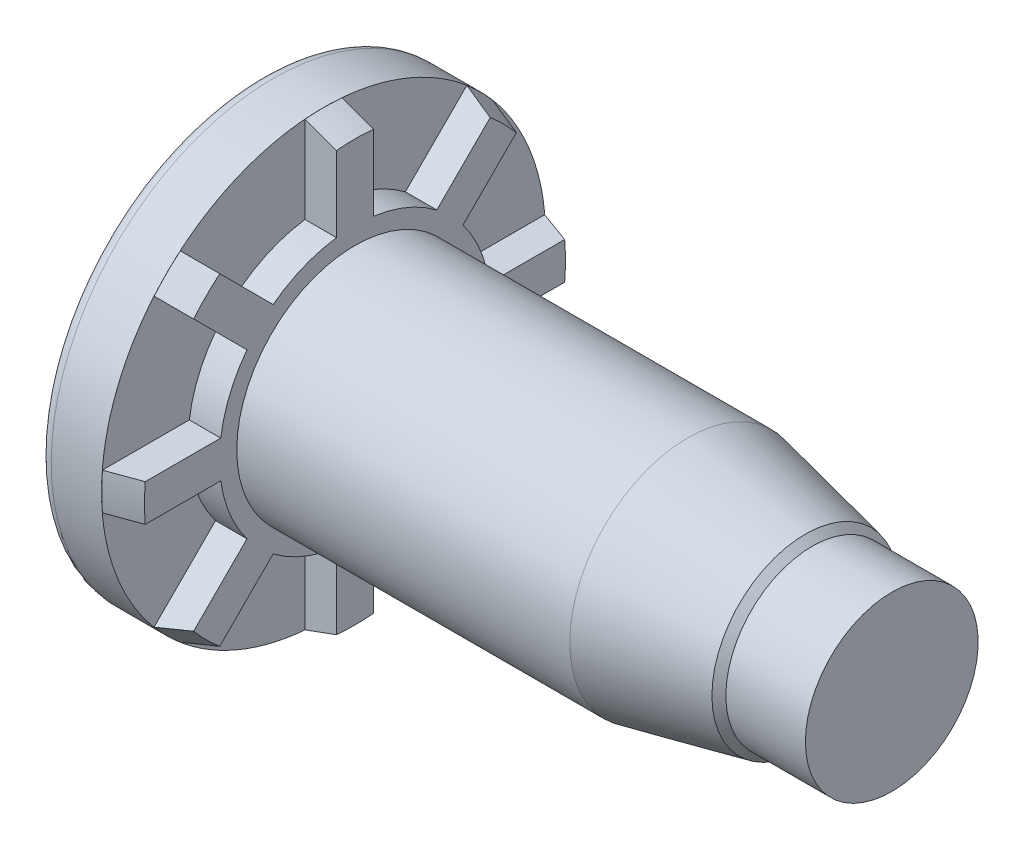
ISO-10303-21;
HEADER;
FILE_DESCRIPTION(('STEP AP214'),'2;1');
FILE_NAME('part.step','',(''),(''),'','','');
FILE_SCHEMA(('AUTOMOTIVE_DESIGN { 1 0 10303 214 1 1 1 1 }'));
ENDSEC;
DATA;
#1=APPLICATION_CONTEXT('core data for automotive mechanical design processes');
#2=APPLICATION_PROTOCOL_DEFINITION('international standard','automotive_design',2000,#1);
#3=PRODUCT_CONTEXT('',#1,'mechanical');
#4=PRODUCT('Part','Part','',(#3));
#5=PRODUCT_RELATED_PRODUCT_CATEGORY('part','',(#4));
#6=PRODUCT_DEFINITION_FORMATION('','',#4);
#7=PRODUCT_DEFINITION_CONTEXT('part definition',#1,'design');
#8=PRODUCT_DEFINITION('design','',#6,#7);
#9=PRODUCT_DEFINITION_SHAPE('','',#8);
#10=(LENGTH_UNIT() NAMED_UNIT(*) SI_UNIT(.MILLI.,.METRE.));
#11=(NAMED_UNIT(*) PLANE_ANGLE_UNIT() SI_UNIT($,.RADIAN.));
#12=(NAMED_UNIT(*) SI_UNIT($,.STERADIAN.) SOLID_ANGLE_UNIT());
#13=UNCERTAINTY_MEASURE_WITH_UNIT(LENGTH_MEASURE(1.E-05),#10,'distance_accuracy_value','');
#14=(GEOMETRIC_REPRESENTATION_CONTEXT(3) GLOBAL_UNCERTAINTY_ASSIGNED_CONTEXT((#13)) GLOBAL_UNIT_ASSIGNED_CONTEXT((#10,
#11,#12)) REPRESENTATION_CONTEXT('',''));
#15=CARTESIAN_POINT('',(0.,0.,0.));
#16=DIRECTION('',(0.,0.,1.));
#17=DIRECTION('',(1.,0.,0.));
#18=AXIS2_PLACEMENT_3D('',#15,#16,#17);
#19=CARTESIAN_POINT('',(0.00254,0.,0.));
#20=DIRECTION('',(-1.,0.,0.));
#21=DIRECTION('',(0.,0.,1.));
#22=AXIS2_PLACEMENT_3D('',#19,#20,#21);
#23=CONICAL_SURFACE('',#22,7.43966,0.349065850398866);
#24=CARTESIAN_POINT('',(6.28647872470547,0.619855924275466,-5.11507246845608));
#25=CARTESIAN_POINT('',(5.33592173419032,0.619855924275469,-5.46353954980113));
#26=CARTESIAN_POINT('',(4.38522514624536,0.619855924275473,-5.81162536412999));
#27=CARTESIAN_POINT('',(2.48363586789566,0.61985592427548,-6.5072605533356));
#28=CARTESIAN_POINT('',(1.53274317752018,0.619855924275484,-6.85480992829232));
#29=CARTESIAN_POINT('',(-0.36915539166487,0.619855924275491,-7.54959839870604));
#30=CARTESIAN_POINT('',(-1.32016127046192,0.619855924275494,-7.89683749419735));
#31=CARTESIAN_POINT('',(-3.22225385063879,0.619855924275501,-8.59109468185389));
#32=CARTESIAN_POINT('',(-4.17334055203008,0.619855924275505,-8.93811277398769));
#33=CARTESIAN_POINT('',(-5.12445129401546,0.619855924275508,-9.28506493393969));
#34=B_SPLINE_CURVE_WITH_KNOTS('',3,(#24,#25,#26,#27,#28,#29,#30,#31,#32,#33),.UNSPECIFIED.,.F.,
.F.,(4,2,2,2,4),(0.,3.03725027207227,6.07450009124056,9.11174957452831,12.1489994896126),.UNSPECIFIED.);
#35=CARTESIAN_POINT('',(1.05409999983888,0.619855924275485,-7.02964774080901));
#36=VERTEX_POINT('',#35);
#37=CARTESIAN_POINT('',(0.00254,0.619855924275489,-7.41379252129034));
#38=VERTEX_POINT('',#37);
#39=EDGE_CURVE('E327',#36,#38,#34,.T.);
#40=ORIENTED_EDGE('',*,*,#39,.F.);
#41=CARTESIAN_POINT('',(1.0541,0.,0.));
#42=DIRECTION('',(-1.,0.,0.));
#43=DIRECTION('',(0.,0.,1.));
#44=AXIS2_PLACEMENT_3D('',#41,#42,#43);
#45=CIRCLE('',#44,7.05692346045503);
#46=CARTESIAN_POINT('',(1.05409999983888,-0.619855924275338,-7.02964774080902));
#47=VERTEX_POINT('',#46);
#48=EDGE_CURVE('E568',#36,#47,#45,.T.);
#49=ORIENTED_EDGE('',*,*,#48,.T.);
#50=CARTESIAN_POINT('',(-5.12445129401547,-0.619855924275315,-9.28506493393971));
#51=CARTESIAN_POINT('',(-4.1733405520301,-0.619855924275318,-8.93811277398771));
#52=CARTESIAN_POINT('',(-3.2222538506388,-0.619855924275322,-8.5910946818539));
#53=CARTESIAN_POINT('',(-1.32016127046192,-0.619855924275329,-7.89683749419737));
#54=CARTESIAN_POINT('',(-0.369155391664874,-0.619855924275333,-7.54959839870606));
#55=CARTESIAN_POINT('',(1.53274317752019,-0.61985592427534,-6.85480992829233));
#56=CARTESIAN_POINT('',(2.48363586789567,-0.619855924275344,-6.50726055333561));
#57=CARTESIAN_POINT('',(4.38522514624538,-0.619855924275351,-5.81162536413));
#58=CARTESIAN_POINT('',(5.33592173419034,-0.619855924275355,-5.46353954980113));
#59=CARTESIAN_POINT('',(6.28647872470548,-0.619855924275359,-5.11507246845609));
#60=B_SPLINE_CURVE_WITH_KNOTS('',3,(#50,#51,#52,#53,#54,#55,#56,#57,#58,#59),.UNSPECIFIED.,.F.,
.F.,(4,2,2,2,4),(0.,3.03724991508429,6.07449939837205,9.11174921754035,12.1489994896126),.UNSPECIFIED.);
#61=CARTESIAN_POINT('',(0.00254,-0.619855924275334,-7.41379252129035));
#62=VERTEX_POINT('',#61);
#63=EDGE_CURVE('E353',#62,#47,#60,.T.);
#64=ORIENTED_EDGE('',*,*,#63,.F.);
#65=CARTESIAN_POINT('',(0.00254,0.,0.));
#66=DIRECTION('',(-1.,0.,0.));
#67=DIRECTION('',(0.,0.,1.));
#68=AXIS2_PLACEMENT_3D('',#65,#66,#67);
#69=CIRCLE('',#68,7.43966);
#70=EDGE_CURVE('E536',#38,#62,#69,.T.);
#71=ORIENTED_EDGE('',*,*,#70,.F.);
#72=EDGE_LOOP('',(#40,#49,#64,#71));
#73=FACE_BOUND('',#72,.T.);
#74=ADVANCED_FACE('F33',(#73),#23,.T.);
#75=CARTESIAN_POINT('',(0.,0.,0.));
#76=DIRECTION('',(-1.,0.,0.));
#77=DIRECTION('',(0.,0.,1.));
#78=AXIS2_PLACEMENT_3D('',#75,#76,#77);
#79=CYLINDRICAL_SURFACE('',#78,7.43966);
#80=CARTESIAN_POINT('',(0.,0.,0.));
#81=DIRECTION('',(-1.,0.,0.));
#82=DIRECTION('',(0.,0.,1.));
#83=AXIS2_PLACEMENT_3D('',#80,#81,#82);
#84=CIRCLE('',#83,7.43966);
#85=CARTESIAN_POINT('',(0.,0.619855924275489,-7.41379252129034));
#86=VERTEX_POINT('',#85);
#87=CARTESIAN_POINT('',(-1.61121550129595E-10,-0.619855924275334,-7.41379252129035));
#88=VERTEX_POINT('',#87);
#89=EDGE_CURVE('E539',#86,#88,#84,.T.);
#90=ORIENTED_EDGE('',*,*,#89,.F.);
#91=DIRECTION('',(-1.,0.,0.));
#92=VECTOR('',#91,1.);
#93=CARTESIAN_POINT('',(0.,0.619855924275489,-7.41379252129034));
#94=LINE('',#93,#92);
#95=EDGE_CURVE('E11',#86,#38,#94,.F.);
#96=ORIENTED_EDGE('',*,*,#95,.T.);
#97=ORIENTED_EDGE('',*,*,#70,.T.);
#98=DIRECTION('',(-1.,0.,0.));
#99=VECTOR('',#98,1.);
#100=CARTESIAN_POINT('',(0.,-0.619855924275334,-7.41379252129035));
#101=LINE('',#100,#99);
#102=EDGE_CURVE('E604',#62,#88,#101,.T.);
#103=ORIENTED_EDGE('',*,*,#102,.T.);
#104=EDGE_LOOP('',(#90,#96,#97,#103));
#105=FACE_BOUND('',#104,.T.);
#106=ADVANCED_FACE('F715',(#105),#79,.T.);
#107=CARTESIAN_POINT('',(1.05429999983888,-4.5323555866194,-5.40896424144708));
#108=CARTESIAN_POINT('',(0.878977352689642,-4.57765248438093,-5.45426113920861));
#109=CARTESIAN_POINT('',(0.703652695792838,-4.62294549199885,-5.49955414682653));
#110=CARTESIAN_POINT('',(0.352999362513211,-4.71352372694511,-5.59013238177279));
#111=CARTESIAN_POINT('',(0.17767068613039,-4.75880895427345,-5.63541760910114));
#112=CARTESIAN_POINT('',(0.00234000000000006,-4.80409029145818,-5.68069894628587));
#113=B_SPLINE_CURVE_WITH_KNOTS('',3,(#107,#108,#109,#110,#111,#112),.UNSPECIFIED.,.F.,.F.,(4,2,
4),(0.,0.559977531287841,1.11995506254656),.UNSPECIFIED.);
#114=CARTESIAN_POINT('',(1.05409999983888,-4.5324072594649,-5.40901591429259));
#115=VERTEX_POINT('',#114);
#116=CARTESIAN_POINT('',(0.00254,-4.80403863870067,-5.68064729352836));
#117=VERTEX_POINT('',#116);
#118=EDGE_CURVE('E346',#115,#117,#113,.T.);
#119=ORIENTED_EDGE('',*,*,#118,.F.);
#120=CARTESIAN_POINT('',(1.05409999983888,-5.40901591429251,-4.532407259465));
#121=VERTEX_POINT('',#120);
#122=EDGE_CURVE('E718',#115,#121,#45,.T.);
#123=ORIENTED_EDGE('',*,*,#122,.T.);
#124=CARTESIAN_POINT('',(0.00234000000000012,-5.68069894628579,-4.80409029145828));
#125=CARTESIAN_POINT('',(0.17767068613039,-5.63541760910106,-4.75880895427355));
#126=CARTESIAN_POINT('',(0.352999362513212,-5.59013238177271,-4.7135237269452));
#127=CARTESIAN_POINT('',(0.703652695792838,-5.49955414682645,-4.62294549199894));
#128=CARTESIAN_POINT('',(0.878977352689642,-5.45426113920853,-4.57765248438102));
#129=CARTESIAN_POINT('',(1.05429999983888,-5.408964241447,-4.53235558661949));
#130=B_SPLINE_CURVE_WITH_KNOTS('',3,(#124,#125,#126,#127,#128,#129),.UNSPECIFIED.,.F.,.F.,(4,2,
4),(0.,0.559977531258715,1.11995506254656),.UNSPECIFIED.);
#131=CARTESIAN_POINT('',(0.00254,-5.68064729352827,-4.80403863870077));
#132=VERTEX_POINT('',#131);
#133=EDGE_CURVE('E374',#132,#121,#130,.T.);
#134=ORIENTED_EDGE('',*,*,#133,.F.);
#135=EDGE_CURVE('E710',#117,#132,#69,.T.);
#136=ORIENTED_EDGE('',*,*,#135,.F.);
#137=EDGE_LOOP('',(#119,#123,#134,#136));
#138=FACE_BOUND('',#137,.T.);
#139=ADVANCED_FACE('F768',(#138),#23,.T.);
#140=CARTESIAN_POINT('',(0.,-4.80403863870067,-5.68064729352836));
#141=VERTEX_POINT('',#140);
#142=CARTESIAN_POINT('',(-1.61121550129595E-10,-5.68064729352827,-4.80403863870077));
#143=VERTEX_POINT('',#142);
#144=EDGE_CURVE('E660',#141,#143,#84,.T.);
#145=ORIENTED_EDGE('',*,*,#144,.F.);
#146=DIRECTION('',(-1.,0.,0.));
#147=VECTOR('',#146,1.);
#148=CARTESIAN_POINT('',(0.,-4.80403863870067,-5.68064729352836));
#149=LINE('',#148,#147);
#150=EDGE_CURVE('E607',#141,#117,#149,.F.);
#151=ORIENTED_EDGE('',*,*,#150,.T.);
#152=ORIENTED_EDGE('',*,*,#135,.T.);
#153=DIRECTION('',(-1.,0.,0.));
#154=VECTOR('',#153,1.);
#155=CARTESIAN_POINT('',(0.,-5.68064729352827,-4.80403863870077));
#156=LINE('',#155,#154);
#157=EDGE_CURVE('E598',#132,#143,#156,.T.);
#158=ORIENTED_EDGE('',*,*,#157,.T.);
#159=EDGE_LOOP('',(#145,#151,#152,#158));
#160=FACE_BOUND('',#159,.T.);
#161=ADVANCED_FACE('F661',(#160),#79,.T.);
#162=CARTESIAN_POINT('',(6.33484410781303,-5.09733967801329,-0.619855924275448));
#163=CARTESIAN_POINT('',(5.3764498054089,-5.44869626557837,-0.619855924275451));
#164=CARTESIAN_POINT('',(4.41791254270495,-5.7996624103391,-0.619855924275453));
#165=CARTESIAN_POINT('',(2.50063766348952,-6.50104663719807,-0.619855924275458));
#166=CARTESIAN_POINT('',(1.54190004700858,-6.85146471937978,-0.61985592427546));
#167=CARTESIAN_POINT('',(-0.375690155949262,-7.55198571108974,-0.619855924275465));
#168=CARTESIAN_POINT('',(-1.33454274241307,-7.90208862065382,-0.619855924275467));
#169=CARTESIAN_POINT('',(-3.25232985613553,-8.60207038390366,-0.619855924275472));
#170=CARTESIAN_POINT('',(-4.21126438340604,-8.9519492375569,-0.619855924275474));
#171=CARTESIAN_POINT('',(-5.17022317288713,-9.30176155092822,-0.619855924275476));
#172=B_SPLINE_CURVE_WITH_KNOTS('',3,(#162,#163,#164,#165,#166,#167,#168,#169,#170,#171),
.UNSPECIFIED.,.F.,.F.,(4,2,2,2,4),(0.,3.06230923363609,6.12461800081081,9.18692641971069,
12.2492352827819),.UNSPECIFIED.);
#173=CARTESIAN_POINT('',(1.05409999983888,-7.02964774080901,-0.619855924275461));
#174=VERTEX_POINT('',#173);
#175=CARTESIAN_POINT('',(0.00254,-7.41379252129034,-0.619855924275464));
#176=VERTEX_POINT('',#175);
#177=EDGE_CURVE('E383',#174,#176,#172,.T.);
#178=ORIENTED_EDGE('',*,*,#177,.F.);
#179=CARTESIAN_POINT('',(1.05409999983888,-7.02964774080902,0.619855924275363));
#180=VERTEX_POINT('',#179);
#181=EDGE_CURVE('E722',#174,#180,#45,.T.);
#182=ORIENTED_EDGE('',*,*,#181,.T.);
#183=CARTESIAN_POINT('',(-5.17022317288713,-9.30176155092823,0.619855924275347));
#184=CARTESIAN_POINT('',(-4.21126438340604,-8.95194923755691,0.61985592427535));
#185=CARTESIAN_POINT('',(-3.25232985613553,-8.60207038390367,0.619855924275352));
#186=CARTESIAN_POINT('',(-1.33454274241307,-7.90208862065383,0.619855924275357));
#187=CARTESIAN_POINT('',(-0.37569015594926,-7.55198571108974,0.619855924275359));
#188=CARTESIAN_POINT('',(1.54190004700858,-6.85146471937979,0.619855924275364));
#189=CARTESIAN_POINT('',(2.50063766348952,-6.50104663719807,0.619855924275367));
#190=CARTESIAN_POINT('',(4.41791254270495,-5.79966241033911,0.619855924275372));
#191=CARTESIAN_POINT('',(5.3764498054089,-5.44869626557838,0.619855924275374));
#192=CARTESIAN_POINT('',(6.33484410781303,-5.0973396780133,0.619855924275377));
#193=B_SPLINE_CURVE_WITH_KNOTS('',3,(#183,#184,#185,#186,#187,#188,#189,#190,#191,#192),
.UNSPECIFIED.,.F.,.F.,(4,2,2,2,4),(0.,3.06230886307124,6.12461728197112,9.18692604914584,
12.2492352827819),.UNSPECIFIED.);
#194=CARTESIAN_POINT('',(0.00254,-7.41379252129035,0.61985592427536));
#195=VERTEX_POINT('',#194);
#196=EDGE_CURVE('E411',#195,#180,#193,.T.);
#197=ORIENTED_EDGE('',*,*,#196,.F.);
#198=EDGE_CURVE('E706',#176,#195,#69,.T.);
#199=ORIENTED_EDGE('',*,*,#198,.F.);
#200=EDGE_LOOP('',(#178,#182,#197,#199));
#201=FACE_BOUND('',#200,.T.);
#202=ADVANCED_FACE('F774',(#201),#23,.T.);
#203=CARTESIAN_POINT('',(0.,-7.41379252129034,-0.619855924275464));
#204=VERTEX_POINT('',#203);
#205=CARTESIAN_POINT('',(-1.61121550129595E-10,-7.41379252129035,0.61985592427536));
#206=VERTEX_POINT('',#205);
#207=EDGE_CURVE('E664',#204,#206,#84,.T.);
#208=ORIENTED_EDGE('',*,*,#207,.F.);
#209=DIRECTION('',(-1.,0.,0.));
#210=VECTOR('',#209,1.);
#211=CARTESIAN_POINT('',(0.,-7.41379252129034,-0.619855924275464));
#212=LINE('',#211,#210);
#213=EDGE_CURVE('E601',#204,#176,#212,.F.);
#214=ORIENTED_EDGE('',*,*,#213,.T.);
#215=ORIENTED_EDGE('',*,*,#198,.T.);
#216=DIRECTION('',(-1.,0.,0.));
#217=VECTOR('',#216,1.);
#218=CARTESIAN_POINT('',(0.,-7.41379252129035,0.61985592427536));
#219=LINE('',#218,#217);
#220=EDGE_CURVE('E592',#195,#206,#219,.T.);
#221=ORIENTED_EDGE('',*,*,#220,.T.);
#222=EDGE_LOOP('',(#208,#214,#215,#221));
#223=FACE_BOUND('',#222,.T.);
#224=ADVANCED_FACE('F799',(#223),#79,.T.);
#225=CARTESIAN_POINT('',(1.05429999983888,-5.40896424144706,4.53235558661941));
#226=CARTESIAN_POINT('',(0.878977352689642,-5.45426113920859,4.57765248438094));
#227=CARTESIAN_POINT('',(0.703652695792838,-5.49955414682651,4.62294549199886));
#228=CARTESIAN_POINT('',(0.352999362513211,-5.59013238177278,4.71352372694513));
#229=CARTESIAN_POINT('',(0.17767068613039,-5.63541760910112,4.75880895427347));
#230=CARTESIAN_POINT('',(0.00234000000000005,-5.68069894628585,4.8040902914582));
#231=B_SPLINE_CURVE_WITH_KNOTS('',3,(#225,#226,#227,#228,#229,#230),.UNSPECIFIED.,.F.,.F.,(4,2,
4),(0.,0.55997753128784,1.11995506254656),.UNSPECIFIED.);
#232=CARTESIAN_POINT('',(1.05409999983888,-5.40901591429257,4.53240725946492));
#233=VERTEX_POINT('',#232);
#234=CARTESIAN_POINT('',(0.00254,-5.68064729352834,4.80403863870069));
#235=VERTEX_POINT('',#234);
#236=EDGE_CURVE('E404',#233,#235,#231,.T.);
#237=ORIENTED_EDGE('',*,*,#236,.F.);
#238=CARTESIAN_POINT('',(1.05409999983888,-4.53240725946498,5.40901591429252));
#239=VERTEX_POINT('',#238);
#240=EDGE_CURVE('E723',#233,#239,#45,.T.);
#241=ORIENTED_EDGE('',*,*,#240,.T.);
#242=CARTESIAN_POINT('',(0.00234000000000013,-4.80409029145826,5.68069894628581));
#243=CARTESIAN_POINT('',(0.17767068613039,-4.75880895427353,5.63541760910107));
#244=CARTESIAN_POINT('',(0.352999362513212,-4.71352372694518,5.59013238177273));
#245=CARTESIAN_POINT('',(0.703652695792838,-4.62294549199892,5.49955414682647));
#246=CARTESIAN_POINT('',(0.878977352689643,-4.577652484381,5.45426113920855));
#247=CARTESIAN_POINT('',(1.05429999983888,-4.53235558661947,5.40896424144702));
#248=B_SPLINE_CURVE_WITH_KNOTS('',3,(#242,#243,#244,#245,#246,#247),.UNSPECIFIED.,.F.,.F.,(4,2,
4),(0.,0.559977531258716,1.11995506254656),.UNSPECIFIED.);
#249=CARTESIAN_POINT('',(0.00254,-4.80403863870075,5.68064729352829));
#250=VERTEX_POINT('',#249);
#251=EDGE_CURVE('E432',#250,#239,#248,.T.);
#252=ORIENTED_EDGE('',*,*,#251,.F.);
#253=EDGE_CURVE('E702',#235,#250,#69,.T.);
#254=ORIENTED_EDGE('',*,*,#253,.F.);
#255=EDGE_LOOP('',(#237,#241,#252,#254));
#256=FACE_BOUND('',#255,.T.);
#257=ADVANCED_FACE('F795',(#256),#23,.T.);
#258=CARTESIAN_POINT('',(0.,-5.68064729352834,4.80403863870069));
#259=VERTEX_POINT('',#258);
#260=CARTESIAN_POINT('',(-1.61121550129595E-10,-4.80403863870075,5.68064729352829));
#261=VERTEX_POINT('',#260);
#262=EDGE_CURVE('E665',#259,#261,#84,.T.);
#263=ORIENTED_EDGE('',*,*,#262,.F.);
#264=DIRECTION('',(-1.,0.,0.));
#265=VECTOR('',#264,1.);
#266=CARTESIAN_POINT('',(0.,-5.68064729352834,4.80403863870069));
#267=LINE('',#266,#265);
#268=EDGE_CURVE('E595',#259,#235,#267,.F.);
#269=ORIENTED_EDGE('',*,*,#268,.T.);
#270=ORIENTED_EDGE('',*,*,#253,.T.);
#271=DIRECTION('',(-1.,0.,0.));
#272=VECTOR('',#271,1.);
#273=CARTESIAN_POINT('',(0.,-4.80403863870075,5.68064729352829));
#274=LINE('',#273,#272);
#275=EDGE_CURVE('E586',#250,#261,#274,.T.);
#276=ORIENTED_EDGE('',*,*,#275,.T.);
#277=EDGE_LOOP('',(#263,#269,#270,#276));
#278=FACE_BOUND('',#277,.T.);
#279=ADVANCED_FACE('F793',(#278),#79,.T.);
#280=CARTESIAN_POINT('',(6.33484410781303,-0.61985592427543,5.09733967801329));
#281=CARTESIAN_POINT('',(5.3764498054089,-0.619855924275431,5.44869626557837));
#282=CARTESIAN_POINT('',(4.41791254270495,-0.619855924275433,5.7996624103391));
#283=CARTESIAN_POINT('',(2.50063766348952,-0.619855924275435,6.50104663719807));
#284=CARTESIAN_POINT('',(1.54190004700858,-0.619855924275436,6.85146471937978));
#285=CARTESIAN_POINT('',(-0.37569015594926,-0.619855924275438,7.55198571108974));
#286=CARTESIAN_POINT('',(-1.33454274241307,-0.619855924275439,7.90208862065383));
#287=CARTESIAN_POINT('',(-3.25232985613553,-0.619855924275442,8.60207038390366));
#288=CARTESIAN_POINT('',(-4.21126438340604,-0.619855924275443,8.9519492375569));
#289=CARTESIAN_POINT('',(-5.17022317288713,-0.619855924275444,9.30176155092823));
#290=B_SPLINE_CURVE_WITH_KNOTS('',3,(#280,#281,#282,#283,#284,#285,#286,#287,#288,#289),
.UNSPECIFIED.,.F.,.F.,(4,2,2,2,4),(0.,3.06230923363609,6.12461800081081,9.18692641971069,
12.2492352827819),.UNSPECIFIED.);
#291=CARTESIAN_POINT('',(1.05409999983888,-0.619855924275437,7.02964774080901));
#292=VERTEX_POINT('',#291);
#293=CARTESIAN_POINT('',(0.00254,-0.619855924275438,7.41379252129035));
#294=VERTEX_POINT('',#293);
#295=EDGE_CURVE('E441',#292,#294,#290,.T.);
#296=ORIENTED_EDGE('',*,*,#295,.F.);
#297=CARTESIAN_POINT('',(1.05409999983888,0.619855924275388,7.02964774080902));
#298=VERTEX_POINT('',#297);
#299=EDGE_CURVE('E729',#292,#298,#45,.T.);
#300=ORIENTED_EDGE('',*,*,#299,.T.);
#301=CARTESIAN_POINT('',(-5.17022317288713,0.619855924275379,9.30176155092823));
#302=CARTESIAN_POINT('',(-4.21126438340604,0.619855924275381,8.9519492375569));
#303=CARTESIAN_POINT('',(-3.25232985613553,0.619855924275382,8.60207038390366));
#304=CARTESIAN_POINT('',(-1.33454274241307,0.619855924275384,7.90208862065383));
#305=CARTESIAN_POINT('',(-0.37569015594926,0.619855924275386,7.55198571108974));
#306=CARTESIAN_POINT('',(1.54190004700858,0.619855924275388,6.85146471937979));
#307=CARTESIAN_POINT('',(2.50063766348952,0.619855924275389,6.50104663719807));
#308=CARTESIAN_POINT('',(4.41791254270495,0.619855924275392,5.79966241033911));
#309=CARTESIAN_POINT('',(5.3764498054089,0.619855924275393,5.44869626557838));
#310=CARTESIAN_POINT('',(6.33484410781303,0.619855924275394,5.0973396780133));
#311=B_SPLINE_CURVE_WITH_KNOTS('',3,(#301,#302,#303,#304,#305,#306,#307,#308,#309,#310),
.UNSPECIFIED.,.F.,.F.,(4,2,2,2,4),(0.,3.06230886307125,6.12461728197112,9.18692604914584,
12.2492352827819),.UNSPECIFIED.);
#312=CARTESIAN_POINT('',(0.00254,0.619855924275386,7.41379252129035));
#313=VERTEX_POINT('',#312);
#314=EDGE_CURVE('E469',#313,#298,#311,.T.);
#315=ORIENTED_EDGE('',*,*,#314,.F.);
#316=EDGE_CURVE('E698',#294,#313,#69,.T.);
#317=ORIENTED_EDGE('',*,*,#316,.F.);
#318=EDGE_LOOP('',(#296,#300,#315,#317));
#319=FACE_BOUND('',#318,.T.);
#320=ADVANCED_FACE('F789',(#319),#23,.T.);
#321=CARTESIAN_POINT('',(0.,-0.619855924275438,7.41379252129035));
#322=VERTEX_POINT('',#321);
#323=CARTESIAN_POINT('',(-1.61121550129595E-10,0.619855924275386,7.41379252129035));
#324=VERTEX_POINT('',#323);
#325=EDGE_CURVE('E668',#322,#324,#84,.T.);
#326=ORIENTED_EDGE('',*,*,#325,.F.);
#327=DIRECTION('',(-1.,0.,0.));
#328=VECTOR('',#327,1.);
#329=CARTESIAN_POINT('',(0.,-0.619855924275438,7.41379252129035));
#330=LINE('',#329,#328);
#331=EDGE_CURVE('E589',#322,#294,#330,.F.);
#332=ORIENTED_EDGE('',*,*,#331,.T.);
#333=ORIENTED_EDGE('',*,*,#316,.T.);
#334=DIRECTION('',(-1.,0.,0.));
#335=VECTOR('',#334,1.);
#336=CARTESIAN_POINT('',(0.,0.619855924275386,7.41379252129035));
#337=LINE('',#336,#335);
#338=EDGE_CURVE('E580',#313,#324,#337,.T.);
#339=ORIENTED_EDGE('',*,*,#338,.T.);
#340=EDGE_LOOP('',(#326,#332,#333,#339));
#341=FACE_BOUND('',#340,.T.);
#342=ADVANCED_FACE('F787',(#341),#79,.T.);
#343=CARTESIAN_POINT('',(1.05429999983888,4.53235558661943,5.40896424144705));
#344=CARTESIAN_POINT('',(0.878977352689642,4.57765248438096,5.45426113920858));
#345=CARTESIAN_POINT('',(0.703652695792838,4.62294549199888,5.4995541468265));
#346=CARTESIAN_POINT('',(0.352999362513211,4.71352372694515,5.59013238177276));
#347=CARTESIAN_POINT('',(0.17767068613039,4.75880895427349,5.63541760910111));
#348=CARTESIAN_POINT('',(0.00234000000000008,4.80409029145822,5.68069894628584));
#349=B_SPLINE_CURVE_WITH_KNOTS('',3,(#343,#344,#345,#346,#347,#348),.UNSPECIFIED.,.F.,.F.,(4,2,
4),(0.,0.559977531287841,1.11995506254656),.UNSPECIFIED.);
#350=CARTESIAN_POINT('',(1.05409999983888,4.53240725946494,5.40901591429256));
#351=VERTEX_POINT('',#350);
#352=CARTESIAN_POINT('',(0.00254,4.80403863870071,5.68064729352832));
#353=VERTEX_POINT('',#352);
#354=EDGE_CURVE('E462',#351,#353,#349,.T.);
#355=ORIENTED_EDGE('',*,*,#354,.F.);
#356=CARTESIAN_POINT('',(1.05409999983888,5.40901591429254,4.53240725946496));
#357=VERTEX_POINT('',#356);
#358=EDGE_CURVE('E734',#351,#357,#45,.T.);
#359=ORIENTED_EDGE('',*,*,#358,.T.);
#360=CARTESIAN_POINT('',(0.00234000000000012,5.68069894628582,4.80409029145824));
#361=CARTESIAN_POINT('',(0.17767068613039,5.63541760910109,4.75880895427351));
#362=CARTESIAN_POINT('',(0.352999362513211,5.59013238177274,4.71352372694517));
#363=CARTESIAN_POINT('',(0.703652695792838,5.49955414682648,4.6229454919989));
#364=CARTESIAN_POINT('',(0.878977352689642,5.45426113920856,4.57765248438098));
#365=CARTESIAN_POINT('',(1.05429999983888,5.40896424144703,4.53235558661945));
#366=B_SPLINE_CURVE_WITH_KNOTS('',3,(#360,#361,#362,#363,#364,#365),.UNSPECIFIED.,.F.,.F.,(4,2,
4),(0.,0.559977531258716,1.11995506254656),.UNSPECIFIED.);
#367=CARTESIAN_POINT('',(0.00254,5.68064729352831,4.80403863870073));
#368=VERTEX_POINT('',#367);
#369=EDGE_CURVE('E490',#368,#357,#366,.T.);
#370=ORIENTED_EDGE('',*,*,#369,.F.);
#371=EDGE_CURVE('E697',#353,#368,#69,.T.);
#372=ORIENTED_EDGE('',*,*,#371,.F.);
#373=EDGE_LOOP('',(#355,#359,#370,#372));
#374=FACE_BOUND('',#373,.T.);
#375=ADVANCED_FACE('F783',(#374),#23,.T.);
#376=CARTESIAN_POINT('',(0.,4.80403863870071,5.68064729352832));
#377=VERTEX_POINT('',#376);
#378=CARTESIAN_POINT('',(-1.61121550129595E-10,5.68064729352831,4.80403863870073));
#379=VERTEX_POINT('',#378);
#380=EDGE_CURVE('E671',#377,#379,#84,.T.);
#381=ORIENTED_EDGE('',*,*,#380,.F.);
#382=DIRECTION('',(-1.,0.,0.));
#383=VECTOR('',#382,1.);
#384=CARTESIAN_POINT('',(0.,4.80403863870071,5.68064729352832));
#385=LINE('',#384,#383);
#386=EDGE_CURVE('E583',#377,#353,#385,.F.);
#387=ORIENTED_EDGE('',*,*,#386,.T.);
#388=ORIENTED_EDGE('',*,*,#371,.T.);
#389=DIRECTION('',(-1.,0.,0.));
#390=VECTOR('',#389,1.);
#391=CARTESIAN_POINT('',(0.,5.68064729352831,4.80403863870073));
#392=LINE('',#391,#390);
#393=EDGE_CURVE('E574',#368,#379,#392,.T.);
#394=ORIENTED_EDGE('',*,*,#393,.T.);
#395=EDGE_LOOP('',(#381,#387,#388,#394));
#396=FACE_BOUND('',#395,.T.);
#397=ADVANCED_FACE('F781',(#396),#79,.T.);
#398=CARTESIAN_POINT('',(6.33484410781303,5.0973396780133,0.619855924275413));
#399=CARTESIAN_POINT('',(5.3764498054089,5.44869626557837,0.619855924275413));
#400=CARTESIAN_POINT('',(4.41791254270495,5.7996624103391,0.619855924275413));
#401=CARTESIAN_POINT('',(2.50063766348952,6.50104663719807,0.619855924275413));
#402=CARTESIAN_POINT('',(1.54190004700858,6.85146471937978,0.619855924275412));
#403=CARTESIAN_POINT('',(-0.375690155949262,7.55198571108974,0.619855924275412));
#404=CARTESIAN_POINT('',(-1.33454274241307,7.90208862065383,0.619855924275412));
#405=CARTESIAN_POINT('',(-3.25232985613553,8.60207038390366,0.619855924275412));
#406=CARTESIAN_POINT('',(-4.21126438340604,8.9519492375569,0.619855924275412));
#407=CARTESIAN_POINT('',(-5.17022317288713,9.30176155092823,0.619855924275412));
#408=B_SPLINE_CURVE_WITH_KNOTS('',3,(#398,#399,#400,#401,#402,#403,#404,#405,#406,#407),
.UNSPECIFIED.,.F.,.F.,(4,2,2,2,4),(0.,3.06230923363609,6.12461800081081,9.18692641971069,
12.2492352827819),.UNSPECIFIED.);
#409=CARTESIAN_POINT('',(1.05409999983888,7.02964774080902,0.619855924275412));
#410=VERTEX_POINT('',#409);
#411=CARTESIAN_POINT('',(0.00254,7.41379252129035,0.619855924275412));
#412=VERTEX_POINT('',#411);
#413=EDGE_CURVE('E499',#410,#412,#408,.T.);
#414=ORIENTED_EDGE('',*,*,#413,.F.);
#415=CARTESIAN_POINT('',(1.05409999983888,7.02964774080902,-0.619855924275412));
#416=VERTEX_POINT('',#415);
#417=EDGE_CURVE('E563',#410,#416,#45,.T.);
#418=ORIENTED_EDGE('',*,*,#417,.T.);
#419=CARTESIAN_POINT('',(-5.17022317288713,9.30176155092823,-0.619855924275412));
#420=CARTESIAN_POINT('',(-4.21126438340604,8.9519492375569,-0.619855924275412));
#421=CARTESIAN_POINT('',(-3.25232985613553,8.60207038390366,-0.619855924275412));
#422=CARTESIAN_POINT('',(-1.33454274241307,7.90208862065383,-0.619855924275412));
#423=CARTESIAN_POINT('',(-0.37569015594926,7.55198571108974,-0.619855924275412));
#424=CARTESIAN_POINT('',(1.54190004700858,6.85146471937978,-0.619855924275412));
#425=CARTESIAN_POINT('',(2.50063766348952,6.50104663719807,-0.619855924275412));
#426=CARTESIAN_POINT('',(4.41791254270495,5.7996624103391,-0.619855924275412));
#427=CARTESIAN_POINT('',(5.3764498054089,5.44869626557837,-0.619855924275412));
#428=CARTESIAN_POINT('',(6.33484410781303,5.0973396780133,-0.619855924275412));
#429=B_SPLINE_CURVE_WITH_KNOTS('',3,(#419,#420,#421,#422,#423,#424,#425,#426,#427,#428),
.UNSPECIFIED.,.F.,.F.,(4,2,2,2,4),(0.,3.06230886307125,6.12461728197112,9.18692604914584,
12.2492352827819),.UNSPECIFIED.);
#430=CARTESIAN_POINT('',(0.00254,7.41379252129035,-0.619855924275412));
#431=VERTEX_POINT('',#430);
#432=EDGE_CURVE('E527',#431,#416,#429,.T.);
#433=ORIENTED_EDGE('',*,*,#432,.F.);
#434=EDGE_CURVE('E526',#412,#431,#69,.T.);
#435=ORIENTED_EDGE('',*,*,#434,.F.);
#436=EDGE_LOOP('',(#414,#418,#433,#435));
#437=FACE_BOUND('',#436,.T.);
#438=ADVANCED_FACE('F745',(#437),#23,.T.);
#439=CARTESIAN_POINT('',(0.,7.41379252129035,0.619855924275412));
#440=VERTEX_POINT('',#439);
#441=CARTESIAN_POINT('',(-1.61121550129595E-10,7.41379252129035,-0.619855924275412));
#442=VERTEX_POINT('',#441);
#443=EDGE_CURVE('E535',#440,#442,#84,.T.);
#444=ORIENTED_EDGE('',*,*,#443,.F.);
#445=DIRECTION('',(-1.,0.,0.));
#446=VECTOR('',#445,1.);
#447=CARTESIAN_POINT('',(0.,7.41379252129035,0.619855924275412));
#448=LINE('',#447,#446);
#449=EDGE_CURVE('E577',#440,#412,#448,.F.);
#450=ORIENTED_EDGE('',*,*,#449,.T.);
#451=ORIENTED_EDGE('',*,*,#434,.T.);
#452=DIRECTION('',(-1.,0.,0.));
#453=VECTOR('',#452,1.);
#454=CARTESIAN_POINT('',(0.,7.41379252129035,-0.619855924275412));
#455=LINE('',#454,#453);
#456=EDGE_CURVE('E567',#431,#442,#455,.T.);
#457=ORIENTED_EDGE('',*,*,#456,.T.);
#458=EDGE_LOOP('',(#444,#450,#451,#457));
#459=FACE_BOUND('',#458,.T.);
#460=ADVANCED_FACE('F693',(#459),#79,.T.);
#461=CARTESIAN_POINT('',(0.00234,4.8040902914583,-5.68069894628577));
#462=CARTESIAN_POINT('',(0.17767068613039,4.75880895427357,-5.63541760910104));
#463=CARTESIAN_POINT('',(0.352999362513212,4.71352372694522,-5.5901323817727));
#464=CARTESIAN_POINT('',(0.703652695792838,4.62294549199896,-5.49955414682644));
#465=CARTESIAN_POINT('',(0.878977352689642,4.57765248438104,-5.45426113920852));
#466=CARTESIAN_POINT('',(1.05429999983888,4.53235558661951,-5.40896424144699));
#467=B_SPLINE_CURVE_WITH_KNOTS('',3,(#461,#462,#463,#464,#465,#466),.UNSPECIFIED.,.F.,.F.,(4,2,
4),(0.,0.559977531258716,1.11995506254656),.UNSPECIFIED.);
#468=CARTESIAN_POINT('',(0.00254,4.80403863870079,-5.68064729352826));
#469=VERTEX_POINT('',#468);
#470=CARTESIAN_POINT('',(1.05409999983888,4.53240725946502,-5.40901591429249));
#471=VERTEX_POINT('',#470);
#472=EDGE_CURVE('E320',#469,#471,#467,.T.);
#473=ORIENTED_EDGE('',*,*,#472,.F.);
#474=CARTESIAN_POINT('',(0.00254,5.68064729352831,-4.80403863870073));
#475=VERTEX_POINT('',#474);
#476=EDGE_CURVE('E532',#475,#469,#69,.T.);
#477=ORIENTED_EDGE('',*,*,#476,.F.);
#478=CARTESIAN_POINT('',(1.05429999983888,5.40896424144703,-4.53235558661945));
#479=CARTESIAN_POINT('',(0.878977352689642,5.45426113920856,-4.57765248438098));
#480=CARTESIAN_POINT('',(0.703652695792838,5.49955414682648,-4.6229454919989));
#481=CARTESIAN_POINT('',(0.352999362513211,5.59013238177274,-4.71352372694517));
#482=CARTESIAN_POINT('',(0.17767068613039,5.63541760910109,-4.75880895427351));
#483=CARTESIAN_POINT('',(0.00234000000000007,5.68069894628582,-4.80409029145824));
#484=B_SPLINE_CURVE_WITH_KNOTS('',3,(#478,#479,#480,#481,#482,#483),.UNSPECIFIED.,.F.,.F.,(4,2,
4),(0.,0.559977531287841,1.11995506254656),.UNSPECIFIED.);
#485=CARTESIAN_POINT('',(1.05409999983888,5.40901591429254,-4.53240725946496));
#486=VERTEX_POINT('',#485);
#487=EDGE_CURVE('E520',#486,#475,#484,.T.);
#488=ORIENTED_EDGE('',*,*,#487,.F.);
#489=EDGE_CURVE('E564',#486,#471,#45,.T.);
#490=ORIENTED_EDGE('',*,*,#489,.T.);
#491=EDGE_LOOP('',(#473,#477,#488,#490));
#492=FACE_BOUND('',#491,.T.);
#493=ADVANCED_FACE('F35',(#492),#23,.T.);
#494=CARTESIAN_POINT('',(1.0541,7.05692346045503,0.));
#495=DIRECTION('',(1.,0.,0.));
#496=DIRECTION('',(0.,0.,-1.));
#497=AXIS2_PLACEMENT_3D('',#494,#495,#496);
#498=PLANE('',#497);
#499=DIRECTION('',(0.,0.,-1.));
#500=VECTOR('',#499,1.);
#501=CARTESIAN_POINT('',(1.05409999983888,0.61985592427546,-4.4998748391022));
#502=LINE('',#501,#500);
#503=CARTESIAN_POINT('',(1.05409999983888,0.61985592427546,-4.4998748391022));
#504=VERTEX_POINT('',#503);
#505=EDGE_CURVE('E300',#504,#36,#502,.T.);
#506=ORIENTED_EDGE('',*,*,#505,.F.);
#507=CARTESIAN_POINT('',(1.05409999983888,0.,0.));
#508=DIRECTION('',(-1.,0.,0.));
#509=DIRECTION('',(0.,-0.707106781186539,-0.707106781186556));
#510=AXIS2_PLACEMENT_3D('',#507,#508,#509);
#511=CIRCLE('',#510,4.54236666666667);
#512=CARTESIAN_POINT('',(1.05409999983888,2.74358768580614,-3.62019634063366));
#513=VERTEX_POINT('',#512);
#514=EDGE_CURVE('E317',#513,#504,#511,.T.);
#515=ORIENTED_EDGE('',*,*,#514,.F.);
#516=DIRECTION('',(0.,-0.707106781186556,0.707106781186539));
#517=VECTOR('',#516,1.);
#518=CARTESIAN_POINT('',(1.05409999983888,2.74358768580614,-3.62019634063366));
#519=LINE('',#518,#517);
#520=EDGE_CURVE('E306',#471,#513,#519,.T.);
#521=ORIENTED_EDGE('',*,*,#520,.F.);
#522=ORIENTED_EDGE('',*,*,#489,.F.);
#523=DIRECTION('',(0.,0.707106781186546,-0.707106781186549));
#524=VECTOR('',#523,1.);
#525=CARTESIAN_POINT('',(1.05409999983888,3.62019634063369,-2.7435876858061));
#526=LINE('',#525,#524);
#527=CARTESIAN_POINT('',(1.05409999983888,3.62019634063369,-2.7435876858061));
#528=VERTEX_POINT('',#527);
#529=EDGE_CURVE('E621',#528,#486,#526,.T.);
#530=ORIENTED_EDGE('',*,*,#529,.F.);
#531=CARTESIAN_POINT('',(1.05409999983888,0.,0.));
#532=DIRECTION('',(-1.,0.,0.));
#533=DIRECTION('',(0.,0.,-1.));
#534=AXIS2_PLACEMENT_3D('',#531,#532,#533);
#535=CIRCLE('',#534,4.54236666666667);
#536=CARTESIAN_POINT('',(1.05409999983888,4.49987483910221,-0.619855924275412));
#537=VERTEX_POINT('',#536);
#538=EDGE_CURVE('E751',#537,#528,#535,.T.);
#539=ORIENTED_EDGE('',*,*,#538,.F.);
#540=DIRECTION('',(0.,-1.,0.));
#541=VECTOR('',#540,1.);
#542=CARTESIAN_POINT('',(1.05409999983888,4.49987483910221,-0.619855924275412));
#543=LINE('',#542,#541);
#544=EDGE_CURVE('E748',#416,#537,#543,.T.);
#545=ORIENTED_EDGE('',*,*,#544,.F.);
#546=ORIENTED_EDGE('',*,*,#417,.F.);
#547=DIRECTION('',(0.,1.,0.));
#548=VECTOR('',#547,1.);
#549=CARTESIAN_POINT('',(1.05409999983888,4.49987483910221,0.619855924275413));
#550=LINE('',#549,#548);
#551=CARTESIAN_POINT('',(1.05409999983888,4.49987483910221,0.619855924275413));
#552=VERTEX_POINT('',#551);
#553=EDGE_CURVE('E477',#552,#410,#550,.T.);
#554=ORIENTED_EDGE('',*,*,#553,.F.);
#555=CARTESIAN_POINT('',(1.05409999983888,0.,0.));
#556=DIRECTION('',(-1.,0.,0.));
#557=DIRECTION('',(0.,0.707106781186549,-0.707106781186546));
#558=AXIS2_PLACEMENT_3D('',#555,#556,#557);
#559=CIRCLE('',#558,4.54236666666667);
#560=CARTESIAN_POINT('',(1.05409999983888,3.62019634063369,2.7435876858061));
#561=VERTEX_POINT('',#560);
#562=EDGE_CURVE('E484',#561,#552,#559,.T.);
#563=ORIENTED_EDGE('',*,*,#562,.F.);
#564=DIRECTION('',(0.,-0.707106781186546,-0.707106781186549));
#565=VECTOR('',#564,1.);
#566=CARTESIAN_POINT('',(1.05409999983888,3.62019634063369,2.7435876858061));
#567=LINE('',#566,#565);
#568=EDGE_CURVE('E468',#357,#561,#567,.T.);
#569=ORIENTED_EDGE('',*,*,#568,.F.);
#570=ORIENTED_EDGE('',*,*,#358,.F.);
#571=DIRECTION('',(0.,0.707106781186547,0.707106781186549));
#572=VECTOR('',#571,1.);
#573=CARTESIAN_POINT('',(1.05409999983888,2.74358768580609,3.6201963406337));
#574=LINE('',#573,#572);
#575=CARTESIAN_POINT('',(1.05409999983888,2.74358768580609,3.6201963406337));
#576=VERTEX_POINT('',#575);
#577=EDGE_CURVE('E861',#576,#351,#574,.T.);
#578=ORIENTED_EDGE('',*,*,#577,.F.);
#579=CARTESIAN_POINT('',(1.05409999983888,0.,0.));
#580=DIRECTION('',(-1.,0.,0.));
#581=DIRECTION('',(0.,1.,0.));
#582=AXIS2_PLACEMENT_3D('',#579,#580,#581);
#583=CIRCLE('',#582,4.54236666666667);
#584=CARTESIAN_POINT('',(1.05409999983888,0.619855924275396,4.49987483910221));
#585=VERTEX_POINT('',#584);
#586=EDGE_CURVE('E863',#585,#576,#583,.T.);
#587=ORIENTED_EDGE('',*,*,#586,.F.);
#588=DIRECTION('',(0.,0.,-1.));
#589=VECTOR('',#588,1.);
#590=CARTESIAN_POINT('',(1.05409999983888,0.619855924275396,4.49987483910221));
#591=LINE('',#590,#589);
#592=EDGE_CURVE('E865',#298,#585,#591,.T.);
#593=ORIENTED_EDGE('',*,*,#592,.F.);
#594=ORIENTED_EDGE('',*,*,#299,.F.);
#595=DIRECTION('',(0.,0.,1.));
#596=VECTOR('',#595,1.);
#597=CARTESIAN_POINT('',(1.05409999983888,-0.619855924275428,4.49987483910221));
#598=LINE('',#597,#596);
#599=CARTESIAN_POINT('',(1.05409999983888,-0.619855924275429,4.49987483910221));
#600=VERTEX_POINT('',#599);
#601=EDGE_CURVE('E419',#600,#292,#598,.T.);
#602=ORIENTED_EDGE('',*,*,#601,.F.);
#603=CARTESIAN_POINT('',(1.05409999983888,0.,0.));
#604=DIRECTION('',(-1.,0.,0.));
#605=DIRECTION('',(0.,0.707106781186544,0.707106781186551));
#606=AXIS2_PLACEMENT_3D('',#603,#604,#605);
#607=CIRCLE('',#606,4.54236666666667);
#608=CARTESIAN_POINT('',(1.05409999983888,-2.74358768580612,3.62019634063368));
#609=VERTEX_POINT('',#608);
#610=EDGE_CURVE('E426',#609,#600,#607,.T.);
#611=ORIENTED_EDGE('',*,*,#610,.F.);
#612=DIRECTION('',(0.,0.707106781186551,-0.707106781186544));
#613=VECTOR('',#612,1.);
#614=CARTESIAN_POINT('',(1.05409999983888,-2.74358768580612,3.62019634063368));
#615=LINE('',#614,#613);
#616=EDGE_CURVE('E410',#239,#609,#615,.T.);
#617=ORIENTED_EDGE('',*,*,#616,.F.);
#618=ORIENTED_EDGE('',*,*,#240,.F.);
#619=DIRECTION('',(0.,-0.707106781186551,0.707106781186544));
#620=VECTOR('',#619,1.);
#621=CARTESIAN_POINT('',(1.05409999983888,-3.62019634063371,2.74358768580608));
#622=LINE('',#621,#620);
#623=CARTESIAN_POINT('',(1.05409999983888,-3.62019634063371,2.74358768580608));
#624=VERTEX_POINT('',#623);
#625=EDGE_CURVE('E821',#624,#233,#622,.T.);
#626=ORIENTED_EDGE('',*,*,#625,.F.);
#627=CARTESIAN_POINT('',(1.05409999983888,0.,0.));
#628=DIRECTION('',(-1.,0.,0.));
#629=DIRECTION('',(0.,0.,1.));
#630=AXIS2_PLACEMENT_3D('',#627,#628,#629);
#631=CIRCLE('',#630,4.54236666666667);
#632=CARTESIAN_POINT('',(1.05409999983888,-4.49987483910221,0.619855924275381));
#633=VERTEX_POINT('',#632);
#634=EDGE_CURVE('E816',#633,#624,#631,.T.);
#635=ORIENTED_EDGE('',*,*,#634,.F.);
#636=DIRECTION('',(0.,1.,0.));
#637=VECTOR('',#636,1.);
#638=CARTESIAN_POINT('',(1.05409999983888,-4.49987483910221,0.619855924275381));
#639=LINE('',#638,#637);
#640=EDGE_CURVE('E810',#180,#633,#639,.T.);
#641=ORIENTED_EDGE('',*,*,#640,.F.);
#642=ORIENTED_EDGE('',*,*,#181,.F.);
#643=DIRECTION('',(0.,-1.,0.));
#644=VECTOR('',#643,1.);
#645=CARTESIAN_POINT('',(1.05409999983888,-4.4998748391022,-0.619855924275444));
#646=LINE('',#645,#644);
#647=CARTESIAN_POINT('',(1.05409999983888,-4.4998748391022,-0.619855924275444));
#648=VERTEX_POINT('',#647);
#649=EDGE_CURVE('E361',#648,#174,#646,.T.);
#650=ORIENTED_EDGE('',*,*,#649,.F.);
#651=CARTESIAN_POINT('',(1.05409999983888,0.,0.));
#652=DIRECTION('',(-1.,0.,0.));
#653=DIRECTION('',(0.,-0.707106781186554,0.707106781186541));
#654=AXIS2_PLACEMENT_3D('',#651,#652,#653);
#655=CIRCLE('',#654,4.54236666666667);
#656=CARTESIAN_POINT('',(1.05409999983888,-3.62019634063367,-2.74358768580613));
#657=VERTEX_POINT('',#656);
#658=EDGE_CURVE('E368',#657,#648,#655,.T.);
#659=ORIENTED_EDGE('',*,*,#658,.F.);
#660=DIRECTION('',(0.,0.707106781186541,0.707106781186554));
#661=VECTOR('',#660,1.);
#662=CARTESIAN_POINT('',(1.05409999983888,-3.62019634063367,-2.74358768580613));
#663=LINE('',#662,#661);
#664=EDGE_CURVE('E352',#121,#657,#663,.T.);
#665=ORIENTED_EDGE('',*,*,#664,.F.);
#666=ORIENTED_EDGE('',*,*,#122,.F.);
#667=DIRECTION('',(0.,-0.707106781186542,-0.707106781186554));
#668=VECTOR('',#667,1.);
#669=CARTESIAN_POINT('',(1.05409999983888,-2.74358768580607,-3.62019634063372));
#670=LINE('',#669,#668);
#671=CARTESIAN_POINT('',(1.05409999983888,-2.74358768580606,-3.62019634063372));
#672=VERTEX_POINT('',#671);
#673=EDGE_CURVE('E638',#672,#115,#670,.T.);
#674=ORIENTED_EDGE('',*,*,#673,.F.);
#675=CARTESIAN_POINT('',(1.05409999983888,0.,0.));
#676=DIRECTION('',(-1.,0.,0.));
#677=DIRECTION('',(0.,-1.,0.));
#678=AXIS2_PLACEMENT_3D('',#675,#676,#677);
#679=CIRCLE('',#678,4.54236666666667);
#680=CARTESIAN_POINT('',(1.05409999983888,-0.619855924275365,-4.49987483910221));
#681=VERTEX_POINT('',#680);
#682=EDGE_CURVE('E632',#681,#672,#679,.T.);
#683=ORIENTED_EDGE('',*,*,#682,.F.);
#684=DIRECTION('',(0.,0.,1.));
#685=VECTOR('',#684,1.);
#686=CARTESIAN_POINT('',(1.05409999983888,-0.619855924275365,-4.49987483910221));
#687=LINE('',#686,#685);
#688=EDGE_CURVE('E631',#47,#681,#687,.T.);
#689=ORIENTED_EDGE('',*,*,#688,.F.);
#690=ORIENTED_EDGE('',*,*,#48,.F.);
#691=EDGE_LOOP('',(#506,#515,#521,#522,#530,#539,#545,#546,#554,#563,#569,#570,#578,#587,#593,
#594,#602,#611,#617,#618,#626,#635,#641,#642,#650,#659,#665,#666,#674,#683,#689,#690));
#692=FACE_BOUND('',#691,.T.);
#693=CARTESIAN_POINT('',(1.0541,0.,0.));
#694=DIRECTION('',(-1.,0.,0.));
#695=DIRECTION('',(0.,0.,1.));
#696=AXIS2_PLACEMENT_3D('',#693,#694,#695);
#697=CIRCLE('',#696,3.9624);
#698=CARTESIAN_POINT('',(1.0541,0.,3.9624));
#699=VERTEX_POINT('',#698);
#700=EDGE_CURVE('E560',#699,#699,#697,.T.);
#701=ORIENTED_EDGE('',*,*,#700,.T.);
#702=EDGE_LOOP('',(#701));
#703=FACE_BOUND('',#702,.T.);
#704=ADVANCED_FACE('F618',(#692,#703),#498,.T.);
#705=CARTESIAN_POINT('',(0.,0.,0.));
#706=DIRECTION('',(-1.,0.,0.));
#707=DIRECTION('',(0.,0.,1.));
#708=AXIS2_PLACEMENT_3D('',#705,#706,#707);
#709=CYLINDRICAL_SURFACE('',#708,3.9624);
#710=CARTESIAN_POINT('',(12.2174,0.,0.));
#711=DIRECTION('',(-1.,0.,0.));
#712=DIRECTION('',(0.,0.,1.));
#713=AXIS2_PLACEMENT_3D('',#710,#711,#712);
#714=CIRCLE('',#713,3.9624);
#715=CARTESIAN_POINT('',(12.2174,0.,3.9624));
#716=VERTEX_POINT('',#715);
#717=EDGE_CURVE('E557',#716,#716,#714,.T.);
#718=ORIENTED_EDGE('',*,*,#717,.T.);
#719=EDGE_LOOP('',(#718));
#720=FACE_BOUND('',#719,.T.);
#721=ORIENTED_EDGE('',*,*,#700,.F.);
#722=EDGE_LOOP('',(#721));
#723=FACE_BOUND('',#722,.T.);
#724=ADVANCED_FACE('F780',(#720,#723),#709,.T.);
#725=CARTESIAN_POINT('',(12.2174,0.,0.));
#726=DIRECTION('',(-1.,0.,0.));
#727=DIRECTION('',(0.,0.,1.));
#728=AXIS2_PLACEMENT_3D('',#725,#726,#727);
#729=CONICAL_SURFACE('',#728,3.9624,0.208798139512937);
#730=CARTESIAN_POINT('',(16.14932,0.,0.));
#731=DIRECTION('',(-1.,0.,0.));
#732=DIRECTION('',(0.,0.,1.));
#733=AXIS2_PLACEMENT_3D('',#730,#731,#732);
#734=CIRCLE('',#733,3.12928);
#735=CARTESIAN_POINT('',(16.14932,0.,3.12928));
#736=VERTEX_POINT('',#735);
#737=EDGE_CURVE('E554',#736,#736,#734,.T.);
#738=ORIENTED_EDGE('',*,*,#737,.T.);
#739=EDGE_LOOP('',(#738));
#740=FACE_BOUND('',#739,.T.);
#741=ORIENTED_EDGE('',*,*,#717,.F.);
#742=EDGE_LOOP('',(#741));
#743=FACE_BOUND('',#742,.T.);
#744=ADVANCED_FACE('F1089',(#740,#743),#729,.T.);
#745=CARTESIAN_POINT('',(16.383,0.,0.));
#746=DIRECTION('',(-1.,0.,0.));
#747=DIRECTION('',(0.,0.,1.));
#748=AXIS2_PLACEMENT_3D('',#745,#746,#747);
#749=CONICAL_SURFACE('',#748,2.8956,0.785398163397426);
#750=ORIENTED_EDGE('',*,*,#737,.F.);
#751=EDGE_LOOP('',(#750));
#752=FACE_BOUND('',#751,.T.);
#753=CARTESIAN_POINT('',(16.383,0.,0.));
#754=DIRECTION('',(-1.,0.,0.));
#755=DIRECTION('',(0.,0.,1.));
#756=AXIS2_PLACEMENT_3D('',#753,#754,#755);
#757=CIRCLE('',#756,2.8956);
#758=CARTESIAN_POINT('',(16.383,0.,2.8956));
#759=VERTEX_POINT('',#758);
#760=EDGE_CURVE('E551',#759,#759,#757,.T.);
#761=ORIENTED_EDGE('',*,*,#760,.T.);
#762=EDGE_LOOP('',(#761));
#763=FACE_BOUND('',#762,.T.);
#764=ADVANCED_FACE('F1079',(#752,#763),#749,.T.);
#765=CARTESIAN_POINT('',(0.,0.,0.));
#766=DIRECTION('',(-1.,0.,0.));
#767=DIRECTION('',(0.,0.,1.));
#768=AXIS2_PLACEMENT_3D('',#765,#766,#767);
#769=CYLINDRICAL_SURFACE('',#768,2.8956);
#770=CARTESIAN_POINT('',(19.05,0.,0.));
#771=DIRECTION('',(-1.,0.,0.));
#772=DIRECTION('',(0.,0.,1.));
#773=AXIS2_PLACEMENT_3D('',#770,#771,#772);
#774=CIRCLE('',#773,2.8956);
#775=CARTESIAN_POINT('',(19.05,0.,2.8956));
#776=VERTEX_POINT('',#775);
#777=EDGE_CURVE('E548',#776,#776,#774,.T.);
#778=ORIENTED_EDGE('',*,*,#777,.T.);
#779=EDGE_LOOP('',(#778));
#780=FACE_BOUND('',#779,.T.);
#781=ORIENTED_EDGE('',*,*,#760,.F.);
#782=EDGE_LOOP('',(#781));
#783=FACE_BOUND('',#782,.T.);
#784=ADVANCED_FACE('F1069',(#780,#783),#769,.T.);
#785=CARTESIAN_POINT('',(19.05,2.8956,0.));
#786=DIRECTION('',(1.,0.,0.));
#787=DIRECTION('',(0.,0.,-1.));
#788=AXIS2_PLACEMENT_3D('',#785,#786,#787);
#789=PLANE('',#788);
#790=ORIENTED_EDGE('',*,*,#777,.F.);
#791=EDGE_LOOP('',(#790));
#792=FACE_BOUND('',#791,.T.);
#793=ADVANCED_FACE('F1059',(#792),#789,.T.);
#794=CARTESIAN_POINT('',(-2.1082,7.02056,0.));
#795=DIRECTION('',(1.,0.,0.));
#796=DIRECTION('',(0.,0.,-1.));
#797=AXIS2_PLACEMENT_3D('',#794,#795,#796);
#798=PLANE('',#797);
#799=CARTESIAN_POINT('',(-2.1082,0.,0.));
#800=DIRECTION('',(-1.,0.,0.));
#801=DIRECTION('',(0.,0.,1.));
#802=AXIS2_PLACEMENT_3D('',#799,#800,#801);
#803=CIRCLE('',#802,7.02056);
#804=CARTESIAN_POINT('',(-2.1082,0.,7.02056));
#805=VERTEX_POINT('',#804);
#806=EDGE_CURVE('E545',#805,#805,#803,.T.);
#807=ORIENTED_EDGE('',*,*,#806,.T.);
#808=EDGE_LOOP('',(#807));
#809=FACE_BOUND('',#808,.T.);
#810=ADVANCED_FACE('F1049',(#809),#798,.F.);
#811=CARTESIAN_POINT('',(-1.68656,0.,0.));
#812=DIRECTION('',(-1.,0.,0.));
#813=DIRECTION('',(0.,0.,1.));
#814=AXIS2_PLACEMENT_3D('',#811,#812,#813);
#815=TOROIDAL_SURFACE('',#814,7.02056,0.42164);
#816=CARTESIAN_POINT('',(-1.68656,0.,0.));
#817=DIRECTION('',(-1.,0.,0.));
#818=DIRECTION('',(0.,0.,1.));
#819=AXIS2_PLACEMENT_3D('',#816,#817,#818);
#820=CIRCLE('',#819,7.4422);
#821=CARTESIAN_POINT('',(-1.68656,0.,7.4422));
#822=VERTEX_POINT('',#821);
#823=EDGE_CURVE('E542',#822,#822,#820,.T.);
#824=ORIENTED_EDGE('',*,*,#823,.T.);
#825=EDGE_LOOP('',(#824));
#826=FACE_BOUND('',#825,.T.);
#827=ORIENTED_EDGE('',*,*,#806,.F.);
#828=EDGE_LOOP('',(#827));
#829=FACE_BOUND('',#828,.T.);
#830=ADVANCED_FACE('F938',(#826,#829),#815,.T.);
#831=CARTESIAN_POINT('',(0.,0.,0.));
#832=DIRECTION('',(-1.,0.,0.));
#833=DIRECTION('',(0.,0.,1.));
#834=AXIS2_PLACEMENT_3D('',#831,#832,#833);
#835=CYLINDRICAL_SURFACE('',#834,7.4422);
#836=CARTESIAN_POINT('',(0.,0.,0.));
#837=DIRECTION('',(-1.,0.,0.));
#838=DIRECTION('',(0.,0.,1.));
#839=AXIS2_PLACEMENT_3D('',#836,#837,#838);
#840=CIRCLE('',#839,7.4422);
#841=CARTESIAN_POINT('',(0.,0.,7.4422));
#842=VERTEX_POINT('',#841);
#843=EDGE_CURVE('E538',#842,#842,#840,.T.);
#844=ORIENTED_EDGE('',*,*,#843,.T.);
#845=EDGE_LOOP('',(#844));
#846=FACE_BOUND('',#845,.T.);
#847=ORIENTED_EDGE('',*,*,#823,.F.);
#848=EDGE_LOOP('',(#847));
#849=FACE_BOUND('',#848,.T.);
#850=ADVANCED_FACE('F928',(#846,#849),#835,.T.);
#851=CARTESIAN_POINT('',(0.,7.43966,0.));
#852=DIRECTION('',(-1.,0.,0.));
#853=DIRECTION('',(0.,0.,1.));
#854=AXIS2_PLACEMENT_3D('',#851,#852,#853);
#855=PLANE('',#854);
#856=DIRECTION('',(0.,0.,-1.));
#857=VECTOR('',#856,1.);
#858=CARTESIAN_POINT('',(-1.61121550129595E-10,0.61985592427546,-4.4998748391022));
#859=LINE('',#858,#857);
#860=CARTESIAN_POINT('',(-1.61121550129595E-10,0.61985592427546,-4.4998748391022));
#861=VERTEX_POINT('',#860);
#862=EDGE_CURVE('E49',#861,#86,#859,.T.);
#863=ORIENTED_EDGE('',*,*,#862,.T.);
#864=ORIENTED_EDGE('',*,*,#89,.T.);
#865=DIRECTION('',(0.,0.,1.));
#866=VECTOR('',#865,1.);
#867=CARTESIAN_POINT('',(-1.61121550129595E-10,-0.619855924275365,-4.49987483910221));
#868=LINE('',#867,#866);
#869=CARTESIAN_POINT('',(-1.61121550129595E-10,-0.619855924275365,-4.49987483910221));
#870=VERTEX_POINT('',#869);
#871=EDGE_CURVE('E644',#88,#870,#868,.T.);
#872=ORIENTED_EDGE('',*,*,#871,.T.);
#873=CARTESIAN_POINT('',(-1.61121550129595E-10,0.,0.));
#874=DIRECTION('',(-1.,0.,0.));
#875=DIRECTION('',(0.,-1.,0.));
#876=AXIS2_PLACEMENT_3D('',#873,#874,#875);
#877=CIRCLE('',#876,4.54236666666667);
#878=CARTESIAN_POINT('',(-1.61121550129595E-10,-2.74358768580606,-3.62019634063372));
#879=VERTEX_POINT('',#878);
#880=EDGE_CURVE('E650',#870,#879,#877,.T.);
#881=ORIENTED_EDGE('',*,*,#880,.T.);
#882=DIRECTION('',(0.,-0.707106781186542,-0.707106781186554));
#883=VECTOR('',#882,1.);
#884=CARTESIAN_POINT('',(-1.61121550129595E-10,-2.74358768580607,-3.62019634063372));
#885=LINE('',#884,#883);
#886=EDGE_CURVE('E56',#879,#141,#885,.T.);
#887=ORIENTED_EDGE('',*,*,#886,.T.);
#888=ORIENTED_EDGE('',*,*,#144,.T.);
#889=DIRECTION('',(0.,0.707106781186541,0.707106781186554));
#890=VECTOR('',#889,1.);
#891=CARTESIAN_POINT('',(-1.61121550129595E-10,-3.62019634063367,-2.74358768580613));
#892=LINE('',#891,#890);
#893=CARTESIAN_POINT('',(-1.61121550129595E-10,-3.62019634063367,-2.74358768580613));
#894=VERTEX_POINT('',#893);
#895=EDGE_CURVE('E358',#143,#894,#892,.T.);
#896=ORIENTED_EDGE('',*,*,#895,.T.);
#897=CARTESIAN_POINT('',(-1.61121550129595E-10,0.,0.));
#898=DIRECTION('',(-1.,0.,0.));
#899=DIRECTION('',(0.,-0.707106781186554,0.707106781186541));
#900=AXIS2_PLACEMENT_3D('',#897,#898,#899);
#901=CIRCLE('',#900,4.54236666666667);
#902=CARTESIAN_POINT('',(-1.61121550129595E-10,-4.4998748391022,-0.619855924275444));
#903=VERTEX_POINT('',#902);
#904=EDGE_CURVE('E360',#894,#903,#901,.T.);
#905=ORIENTED_EDGE('',*,*,#904,.T.);
#906=DIRECTION('',(0.,-1.,0.));
#907=VECTOR('',#906,1.);
#908=CARTESIAN_POINT('',(-1.61121550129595E-10,-4.4998748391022,-0.619855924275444));
#909=LINE('',#908,#907);
#910=EDGE_CURVE('E364',#903,#204,#909,.T.);
#911=ORIENTED_EDGE('',*,*,#910,.T.);
#912=ORIENTED_EDGE('',*,*,#207,.T.);
#913=DIRECTION('',(0.,1.,0.));
#914=VECTOR('',#913,1.);
#915=CARTESIAN_POINT('',(-1.61121550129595E-10,-4.49987483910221,0.619855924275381));
#916=LINE('',#915,#914);
#917=CARTESIAN_POINT('',(-1.61121550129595E-10,-4.49987483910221,0.619855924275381));
#918=VERTEX_POINT('',#917);
#919=EDGE_CURVE('E828',#206,#918,#916,.T.);
#920=ORIENTED_EDGE('',*,*,#919,.T.);
#921=CARTESIAN_POINT('',(-1.61121550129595E-10,0.,0.));
#922=DIRECTION('',(-1.,0.,0.));
#923=DIRECTION('',(0.,0.,1.));
#924=AXIS2_PLACEMENT_3D('',#921,#922,#923);
#925=CIRCLE('',#924,4.54236666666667);
#926=CARTESIAN_POINT('',(-1.61121550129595E-10,-3.62019634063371,2.74358768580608));
#927=VERTEX_POINT('',#926);
#928=EDGE_CURVE('E833',#918,#927,#925,.T.);
#929=ORIENTED_EDGE('',*,*,#928,.T.);
#930=DIRECTION('',(0.,-0.707106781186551,0.707106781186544));
#931=VECTOR('',#930,1.);
#932=CARTESIAN_POINT('',(-1.61121550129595E-10,-3.62019634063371,2.74358768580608));
#933=LINE('',#932,#931);
#934=EDGE_CURVE('E824',#927,#259,#933,.T.);
#935=ORIENTED_EDGE('',*,*,#934,.T.);
#936=ORIENTED_EDGE('',*,*,#262,.T.);
#937=DIRECTION('',(0.,0.707106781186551,-0.707106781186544));
#938=VECTOR('',#937,1.);
#939=CARTESIAN_POINT('',(-1.61121550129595E-10,-2.74358768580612,3.62019634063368));
#940=LINE('',#939,#938);
#941=CARTESIAN_POINT('',(-1.61121550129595E-10,-2.74358768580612,3.62019634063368));
#942=VERTEX_POINT('',#941);
#943=EDGE_CURVE('E416',#261,#942,#940,.T.);
#944=ORIENTED_EDGE('',*,*,#943,.T.);
#945=CARTESIAN_POINT('',(-1.61121550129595E-10,0.,0.));
#946=DIRECTION('',(-1.,0.,0.));
#947=DIRECTION('',(0.,0.707106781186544,0.707106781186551));
#948=AXIS2_PLACEMENT_3D('',#945,#946,#947);
#949=CIRCLE('',#948,4.54236666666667);
#950=CARTESIAN_POINT('',(-1.61121550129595E-10,-0.619855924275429,4.49987483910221));
#951=VERTEX_POINT('',#950);
#952=EDGE_CURVE('E418',#942,#951,#949,.T.);
#953=ORIENTED_EDGE('',*,*,#952,.T.);
#954=DIRECTION('',(0.,0.,1.));
#955=VECTOR('',#954,1.);
#956=CARTESIAN_POINT('',(-1.61121550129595E-10,-0.619855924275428,4.49987483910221));
#957=LINE('',#956,#955);
#958=EDGE_CURVE('E422',#951,#322,#957,.T.);
#959=ORIENTED_EDGE('',*,*,#958,.T.);
#960=ORIENTED_EDGE('',*,*,#325,.T.);
#961=DIRECTION('',(0.,0.,-1.));
#962=VECTOR('',#961,1.);
#963=CARTESIAN_POINT('',(-1.61121550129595E-10,0.619855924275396,4.49987483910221));
#964=LINE('',#963,#962);
#965=CARTESIAN_POINT('',(-1.61121550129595E-10,0.619855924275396,4.49987483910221));
#966=VERTEX_POINT('',#965);
#967=EDGE_CURVE('E852',#324,#966,#964,.T.);
#968=ORIENTED_EDGE('',*,*,#967,.T.);
#969=CARTESIAN_POINT('',(-1.61121550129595E-10,0.,0.));
#970=DIRECTION('',(-1.,0.,0.));
#971=DIRECTION('',(0.,1.,0.));
#972=AXIS2_PLACEMENT_3D('',#969,#970,#971);
#973=CIRCLE('',#972,4.54236666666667);
#974=CARTESIAN_POINT('',(-1.61121550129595E-10,2.74358768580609,3.6201963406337));
#975=VERTEX_POINT('',#974);
#976=EDGE_CURVE('E868',#966,#975,#973,.T.);
#977=ORIENTED_EDGE('',*,*,#976,.T.);
#978=DIRECTION('',(0.,0.707106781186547,0.707106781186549));
#979=VECTOR('',#978,1.);
#980=CARTESIAN_POINT('',(-1.61121550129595E-10,2.74358768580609,3.6201963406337));
#981=LINE('',#980,#979);
#982=EDGE_CURVE('E859',#975,#377,#981,.T.);
#983=ORIENTED_EDGE('',*,*,#982,.T.);
#984=ORIENTED_EDGE('',*,*,#380,.T.);
#985=DIRECTION('',(0.,-0.707106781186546,-0.707106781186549));
#986=VECTOR('',#985,1.);
#987=CARTESIAN_POINT('',(-1.61121550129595E-10,3.62019634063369,2.7435876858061));
#988=LINE('',#987,#986);
#989=CARTESIAN_POINT('',(-1.61121550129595E-10,3.62019634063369,2.7435876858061));
#990=VERTEX_POINT('',#989);
#991=EDGE_CURVE('E474',#379,#990,#988,.T.);
#992=ORIENTED_EDGE('',*,*,#991,.T.);
#993=CARTESIAN_POINT('',(-1.61121550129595E-10,0.,0.));
#994=DIRECTION('',(-1.,0.,0.));
#995=DIRECTION('',(0.,0.707106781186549,-0.707106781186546));
#996=AXIS2_PLACEMENT_3D('',#993,#994,#995);
#997=CIRCLE('',#996,4.54236666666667);
#998=CARTESIAN_POINT('',(-1.61121550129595E-10,4.49987483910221,0.619855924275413));
#999=VERTEX_POINT('',#998);
#1000=EDGE_CURVE('E476',#990,#999,#997,.T.);
#1001=ORIENTED_EDGE('',*,*,#1000,.T.);
#1002=DIRECTION('',(0.,1.,0.));
#1003=VECTOR('',#1002,1.);
#1004=CARTESIAN_POINT('',(-1.61121550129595E-10,4.49987483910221,0.619855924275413));
#1005=LINE('',#1004,#1003);
#1006=EDGE_CURVE('E480',#999,#440,#1005,.T.);
#1007=ORIENTED_EDGE('',*,*,#1006,.T.);
#1008=ORIENTED_EDGE('',*,*,#443,.T.);
#1009=DIRECTION('',(0.,-1.,0.));
#1010=VECTOR('',#1009,1.);
#1011=CARTESIAN_POINT('',(-1.61121550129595E-10,4.49987483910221,-0.619855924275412));
#1012=LINE('',#1011,#1010);
#1013=CARTESIAN_POINT('',(-1.61121550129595E-10,4.49987483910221,-0.619855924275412));
#1014=VERTEX_POINT('',#1013);
#1015=EDGE_CURVE('E679',#442,#1014,#1012,.T.);
#1016=ORIENTED_EDGE('',*,*,#1015,.T.);
#1017=CARTESIAN_POINT('',(-1.61121550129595E-10,0.,0.));
#1018=DIRECTION('',(-1.,0.,0.));
#1019=DIRECTION('',(0.,0.,-1.));
#1020=AXIS2_PLACEMENT_3D('',#1017,#1018,#1019);
#1021=CIRCLE('',#1020,4.54236666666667);
#1022=CARTESIAN_POINT('',(-1.61121550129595E-10,3.62019634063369,-2.7435876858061));
#1023=VERTEX_POINT('',#1022);
#1024=EDGE_CURVE('E692',#1014,#1023,#1021,.T.);
#1025=ORIENTED_EDGE('',*,*,#1024,.T.);
#1026=DIRECTION('',(0.,0.707106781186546,-0.707106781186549));
#1027=VECTOR('',#1026,1.);
#1028=CARTESIAN_POINT('',(-1.61121550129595E-10,3.62019634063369,-2.7435876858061));
#1029=LINE('',#1028,#1027);
#1030=CARTESIAN_POINT('',(0.,5.68064729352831,-4.80403863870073));
#1031=VERTEX_POINT('',#1030);
#1032=EDGE_CURVE('E755',#1023,#1031,#1029,.T.);
#1033=ORIENTED_EDGE('',*,*,#1032,.T.);
#1034=CARTESIAN_POINT('',(-1.61121550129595E-10,4.80403863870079,-5.68064729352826));
#1035=VERTEX_POINT('',#1034);
#1036=EDGE_CURVE('E297',#1031,#1035,#84,.T.);
#1037=ORIENTED_EDGE('',*,*,#1036,.T.);
#1038=DIRECTION('',(0.,-0.707106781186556,0.707106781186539));
#1039=VECTOR('',#1038,1.);
#1040=CARTESIAN_POINT('',(-1.61121550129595E-10,2.74358768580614,-3.62019634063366));
#1041=LINE('',#1040,#1039);
#1042=CARTESIAN_POINT('',(-1.61121550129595E-10,2.74358768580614,-3.62019634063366));
#1043=VERTEX_POINT('',#1042);
#1044=EDGE_CURVE('E290',#1035,#1043,#1041,.T.);
#1045=ORIENTED_EDGE('',*,*,#1044,.T.);
#1046=CARTESIAN_POINT('',(-1.61121550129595E-10,0.,0.));
#1047=DIRECTION('',(-1.,0.,0.));
#1048=DIRECTION('',(0.,-0.707106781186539,-0.707106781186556));
#1049=AXIS2_PLACEMENT_3D('',#1046,#1047,#1048);
#1050=CIRCLE('',#1049,4.54236666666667);
#1051=EDGE_CURVE('E295',#1043,#861,#1050,.T.);
#1052=ORIENTED_EDGE('',*,*,#1051,.T.);
#1053=EDGE_LOOP('',(#863,#864,#872,#881,#887,#888,#896,#905,#911,#912,#920,#929,#935,#936,#944,
#953,#959,#960,#968,#977,#983,#984,#992,#1001,#1007,#1008,#1016,#1025,#1033,#1037,#1045,#1052));
#1054=FACE_BOUND('',#1053,.T.);
#1055=ORIENTED_EDGE('',*,*,#843,.F.);
#1056=EDGE_LOOP('',(#1055));
#1057=FACE_BOUND('',#1056,.T.);
#1058=ADVANCED_FACE('F292',(#1054,#1057),#855,.F.);
#1059=ORIENTED_EDGE('',*,*,#476,.T.);
#1060=DIRECTION('',(-1.,0.,0.));
#1061=VECTOR('',#1060,1.);
#1062=CARTESIAN_POINT('',(0.,4.80403863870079,-5.68064729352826));
#1063=LINE('',#1062,#1061);
#1064=EDGE_CURVE('E42',#469,#1035,#1063,.T.);
#1065=ORIENTED_EDGE('',*,*,#1064,.T.);
#1066=ORIENTED_EDGE('',*,*,#1036,.F.);
#1067=DIRECTION('',(-1.,0.,0.));
#1068=VECTOR('',#1067,1.);
#1069=CARTESIAN_POINT('',(0.,5.68064729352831,-4.80403863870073));
#1070=LINE('',#1069,#1068);
#1071=EDGE_CURVE('E571',#1031,#475,#1070,.F.);
#1072=ORIENTED_EDGE('',*,*,#1071,.T.);
#1073=EDGE_LOOP('',(#1059,#1065,#1066,#1072));
#1074=FACE_BOUND('',#1073,.T.);
#1075=ADVANCED_FACE('F516',(#1074),#79,.T.);
#1076=CARTESIAN_POINT('',(-1.61121550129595E-10,3.62019634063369,-2.7435876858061));
#1077=DIRECTION('',(0.,-0.707106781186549,-0.707106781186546));
#1078=DIRECTION('',(0.,0.707106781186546,-0.707106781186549));
#1079=AXIS2_PLACEMENT_3D('',#1076,#1077,#1078);
#1080=PLANE('',#1079);
#1081=ORIENTED_EDGE('',*,*,#487,.T.);
#1082=ORIENTED_EDGE('',*,*,#1071,.F.);
#1083=ORIENTED_EDGE('',*,*,#1032,.F.);
#1084=DIRECTION('',(1.,0.,0.));
#1085=VECTOR('',#1084,1.);
#1086=CARTESIAN_POINT('',(-1.61121550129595E-10,3.62019634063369,-2.7435876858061));
#1087=LINE('',#1086,#1085);
#1088=EDGE_CURVE('E749',#1023,#528,#1087,.T.);
#1089=ORIENTED_EDGE('',*,*,#1088,.T.);
#1090=ORIENTED_EDGE('',*,*,#529,.T.);
#1091=EDGE_LOOP('',(#1081,#1082,#1083,#1089,#1090));
#1092=FACE_BOUND('',#1091,.T.);
#1093=ADVANCED_FACE('F511',(#1092),#1080,.F.);
#1094=CARTESIAN_POINT('',(-1.61121550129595E-10,0.,0.));
#1095=DIRECTION('',(1.,0.,0.));
#1096=DIRECTION('',(0.,0.,-1.));
#1097=AXIS2_PLACEMENT_3D('',#1094,#1095,#1096);
#1098=CYLINDRICAL_SURFACE('',#1097,4.54236666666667);
#1099=ORIENTED_EDGE('',*,*,#538,.T.);
#1100=ORIENTED_EDGE('',*,*,#1088,.F.);
#1101=ORIENTED_EDGE('',*,*,#1024,.F.);
#1102=DIRECTION('',(1.,0.,0.));
#1103=VECTOR('',#1102,1.);
#1104=CARTESIAN_POINT('',(-1.61121550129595E-10,4.49987483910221,-0.619855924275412));
#1105=LINE('',#1104,#1103);
#1106=EDGE_CURVE('E690',#1014,#537,#1105,.T.);
#1107=ORIENTED_EDGE('',*,*,#1106,.T.);
#1108=EDGE_LOOP('',(#1099,#1100,#1101,#1107));
#1109=FACE_BOUND('',#1108,.T.);
#1110=ADVANCED_FACE('F515',(#1109),#1098,.T.);
#1111=CARTESIAN_POINT('',(-1.61121550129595E-10,4.49987483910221,-0.619855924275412));
#1112=DIRECTION('',(0.,0.,1.));
#1113=DIRECTION('',(1.,0.,0.));
#1114=AXIS2_PLACEMENT_3D('',#1111,#1112,#1113);
#1115=PLANE('',#1114);
#1116=ORIENTED_EDGE('',*,*,#432,.T.);
#1117=ORIENTED_EDGE('',*,*,#544,.T.);
#1118=ORIENTED_EDGE('',*,*,#1106,.F.);
#1119=ORIENTED_EDGE('',*,*,#1015,.F.);
#1120=ORIENTED_EDGE('',*,*,#456,.F.);
#1121=EDGE_LOOP('',(#1116,#1117,#1118,#1119,#1120));
#1122=FACE_BOUND('',#1121,.T.);
#1123=ADVANCED_FACE('F687',(#1122),#1115,.F.);
#1124=CARTESIAN_POINT('',(-1.61121550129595E-10,4.49987483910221,0.619855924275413));
#1125=DIRECTION('',(0.,0.,-1.));
#1126=DIRECTION('',(0.,1.,0.));
#1127=AXIS2_PLACEMENT_3D('',#1124,#1125,#1126);
#1128=PLANE('',#1127);
#1129=ORIENTED_EDGE('',*,*,#413,.T.);
#1130=ORIENTED_EDGE('',*,*,#449,.F.);
#1131=ORIENTED_EDGE('',*,*,#1006,.F.);
#1132=DIRECTION('',(1.,0.,0.));
#1133=VECTOR('',#1132,1.);
#1134=CARTESIAN_POINT('',(-1.61121550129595E-10,4.49987483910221,0.619855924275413));
#1135=LINE('',#1134,#1133);
#1136=EDGE_CURVE('E488',#999,#552,#1135,.T.);
#1137=ORIENTED_EDGE('',*,*,#1136,.T.);
#1138=ORIENTED_EDGE('',*,*,#553,.T.);
#1139=EDGE_LOOP('',(#1129,#1130,#1131,#1137,#1138));
#1140=FACE_BOUND('',#1139,.T.);
#1141=ADVANCED_FACE('F766',(#1140),#1128,.F.);
#1142=CARTESIAN_POINT('',(-1.61121550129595E-10,0.,0.));
#1143=DIRECTION('',(1.,0.,0.));
#1144=DIRECTION('',(0.,0.,-1.));
#1145=AXIS2_PLACEMENT_3D('',#1142,#1143,#1144);
#1146=CYLINDRICAL_SURFACE('',#1145,4.54236666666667);
#1147=ORIENTED_EDGE('',*,*,#562,.T.);
#1148=ORIENTED_EDGE('',*,*,#1136,.F.);
#1149=ORIENTED_EDGE('',*,*,#1000,.F.);
#1150=DIRECTION('',(1.,0.,0.));
#1151=VECTOR('',#1150,1.);
#1152=CARTESIAN_POINT('',(-1.61121550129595E-10,3.62019634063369,2.7435876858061));
#1153=LINE('',#1152,#1151);
#1154=EDGE_CURVE('E482',#990,#561,#1153,.T.);
#1155=ORIENTED_EDGE('',*,*,#1154,.T.);
#1156=EDGE_LOOP('',(#1147,#1148,#1149,#1155));
#1157=FACE_BOUND('',#1156,.T.);
#1158=ADVANCED_FACE('F509',(#1157),#1146,.T.);
#1159=CARTESIAN_POINT('',(-1.61121550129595E-10,3.62019634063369,2.7435876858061));
#1160=DIRECTION('',(0.,-0.707106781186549,0.707106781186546));
#1161=DIRECTION('',(0.,-0.707106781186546,-0.707106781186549));
#1162=AXIS2_PLACEMENT_3D('',#1159,#1160,#1161);
#1163=PLANE('',#1162);
#1164=ORIENTED_EDGE('',*,*,#369,.T.);
#1165=ORIENTED_EDGE('',*,*,#568,.T.);
#1166=ORIENTED_EDGE('',*,*,#1154,.F.);
#1167=ORIENTED_EDGE('',*,*,#991,.F.);
#1168=ORIENTED_EDGE('',*,*,#393,.F.);
#1169=EDGE_LOOP('',(#1164,#1165,#1166,#1167,#1168));
#1170=FACE_BOUND('',#1169,.T.);
#1171=ADVANCED_FACE('F458',(#1170),#1163,.F.);
#1172=CARTESIAN_POINT('',(-1.61121550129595E-10,2.74358768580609,3.6201963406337));
#1173=DIRECTION('',(0.,0.707106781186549,-0.707106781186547));
#1174=DIRECTION('',(0.,0.707106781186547,0.707106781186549));
#1175=AXIS2_PLACEMENT_3D('',#1172,#1173,#1174);
#1176=PLANE('',#1175);
#1177=ORIENTED_EDGE('',*,*,#354,.T.);
#1178=ORIENTED_EDGE('',*,*,#386,.F.);
#1179=ORIENTED_EDGE('',*,*,#982,.F.);
#1180=DIRECTION('',(1.,0.,0.));
#1181=VECTOR('',#1180,1.);
#1182=CARTESIAN_POINT('',(-1.61121550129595E-10,2.74358768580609,3.6201963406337));
#1183=LINE('',#1182,#1181);
#1184=EDGE_CURVE('E853',#975,#576,#1183,.T.);
#1185=ORIENTED_EDGE('',*,*,#1184,.T.);
#1186=ORIENTED_EDGE('',*,*,#577,.T.);
#1187=EDGE_LOOP('',(#1177,#1178,#1179,#1185,#1186));
#1188=FACE_BOUND('',#1187,.T.);
#1189=ADVANCED_FACE('F453',(#1188),#1176,.F.);
#1190=CARTESIAN_POINT('',(-1.61121550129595E-10,0.,0.));
#1191=DIRECTION('',(1.,0.,0.));
#1192=DIRECTION('',(0.,0.,-1.));
#1193=AXIS2_PLACEMENT_3D('',#1190,#1191,#1192);
#1194=CYLINDRICAL_SURFACE('',#1193,4.54236666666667);
#1195=ORIENTED_EDGE('',*,*,#586,.T.);
#1196=ORIENTED_EDGE('',*,*,#1184,.F.);
#1197=ORIENTED_EDGE('',*,*,#976,.F.);
#1198=DIRECTION('',(1.,0.,0.));
#1199=VECTOR('',#1198,1.);
#1200=CARTESIAN_POINT('',(-1.61121550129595E-10,0.619855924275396,4.49987483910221));
#1201=LINE('',#1200,#1199);
#1202=EDGE_CURVE('E854',#966,#585,#1201,.T.);
#1203=ORIENTED_EDGE('',*,*,#1202,.T.);
#1204=EDGE_LOOP('',(#1195,#1196,#1197,#1203));
#1205=FACE_BOUND('',#1204,.T.);
#1206=ADVANCED_FACE('F457',(#1205),#1194,.T.);
#1207=CARTESIAN_POINT('',(-1.61121550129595E-10,0.619855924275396,4.49987483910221));
#1208=DIRECTION('',(0.,-1.,0.));
#1209=DIRECTION('',(0.,0.,-1.));
#1210=AXIS2_PLACEMENT_3D('',#1207,#1208,#1209);
#1211=PLANE('',#1210);
#1212=ORIENTED_EDGE('',*,*,#314,.T.);
#1213=ORIENTED_EDGE('',*,*,#592,.T.);
#1214=ORIENTED_EDGE('',*,*,#1202,.F.);
#1215=ORIENTED_EDGE('',*,*,#967,.F.);
#1216=ORIENTED_EDGE('',*,*,#338,.F.);
#1217=EDGE_LOOP('',(#1212,#1213,#1214,#1215,#1216));
#1218=FACE_BOUND('',#1217,.T.);
#1219=ADVANCED_FACE('F849',(#1218),#1211,.F.);
#1220=CARTESIAN_POINT('',(-1.61121550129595E-10,-0.619855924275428,4.49987483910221));
#1221=DIRECTION('',(0.,1.,0.));
#1222=DIRECTION('',(0.,0.,1.));
#1223=AXIS2_PLACEMENT_3D('',#1220,#1221,#1222);
#1224=PLANE('',#1223);
#1225=ORIENTED_EDGE('',*,*,#295,.T.);
#1226=ORIENTED_EDGE('',*,*,#331,.F.);
#1227=ORIENTED_EDGE('',*,*,#958,.F.);
#1228=DIRECTION('',(1.,0.,0.));
#1229=VECTOR('',#1228,1.);
#1230=CARTESIAN_POINT('',(-1.61121550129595E-10,-0.619855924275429,4.49987483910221));
#1231=LINE('',#1230,#1229);
#1232=EDGE_CURVE('E430',#951,#600,#1231,.T.);
#1233=ORIENTED_EDGE('',*,*,#1232,.T.);
#1234=ORIENTED_EDGE('',*,*,#601,.T.);
#1235=EDGE_LOOP('',(#1225,#1226,#1227,#1233,#1234));
#1236=FACE_BOUND('',#1235,.T.);
#1237=ADVANCED_FACE('F847',(#1236),#1224,.F.);
#1238=CARTESIAN_POINT('',(-1.61121550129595E-10,0.,0.));
#1239=DIRECTION('',(1.,0.,0.));
#1240=DIRECTION('',(0.,0.,-1.));
#1241=AXIS2_PLACEMENT_3D('',#1238,#1239,#1240);
#1242=CYLINDRICAL_SURFACE('',#1241,4.54236666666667);
#1243=ORIENTED_EDGE('',*,*,#610,.T.);
#1244=ORIENTED_EDGE('',*,*,#1232,.F.);
#1245=ORIENTED_EDGE('',*,*,#952,.F.);
#1246=DIRECTION('',(1.,0.,0.));
#1247=VECTOR('',#1246,1.);
#1248=CARTESIAN_POINT('',(-1.61121550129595E-10,-2.74358768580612,3.62019634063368));
#1249=LINE('',#1248,#1247);
#1250=EDGE_CURVE('E424',#942,#609,#1249,.T.);
#1251=ORIENTED_EDGE('',*,*,#1250,.T.);
#1252=EDGE_LOOP('',(#1243,#1244,#1245,#1251));
#1253=FACE_BOUND('',#1252,.T.);
#1254=ADVANCED_FACE('F451',(#1253),#1242,.T.);
#1255=CARTESIAN_POINT('',(-1.61121550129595E-10,-2.74358768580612,3.62019634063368));
#1256=DIRECTION('',(0.,-0.707106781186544,-0.707106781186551));
#1257=DIRECTION('',(0.,0.707106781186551,-0.707106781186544));
#1258=AXIS2_PLACEMENT_3D('',#1255,#1256,#1257);
#1259=PLANE('',#1258);
#1260=ORIENTED_EDGE('',*,*,#251,.T.);
#1261=ORIENTED_EDGE('',*,*,#616,.T.);
#1262=ORIENTED_EDGE('',*,*,#1250,.F.);
#1263=ORIENTED_EDGE('',*,*,#943,.F.);
#1264=ORIENTED_EDGE('',*,*,#275,.F.);
#1265=EDGE_LOOP('',(#1260,#1261,#1262,#1263,#1264));
#1266=FACE_BOUND('',#1265,.T.);
#1267=ADVANCED_FACE('F400',(#1266),#1259,.F.);
#1268=CARTESIAN_POINT('',(-1.61121550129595E-10,-3.62019634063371,2.74358768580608));
#1269=DIRECTION('',(0.,0.707106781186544,0.707106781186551));
#1270=DIRECTION('',(0.,-0.707106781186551,0.707106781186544));
#1271=AXIS2_PLACEMENT_3D('',#1268,#1269,#1270);
#1272=PLANE('',#1271);
#1273=ORIENTED_EDGE('',*,*,#236,.T.);
#1274=ORIENTED_EDGE('',*,*,#268,.F.);
#1275=ORIENTED_EDGE('',*,*,#934,.F.);
#1276=DIRECTION('',(1.,0.,0.));
#1277=VECTOR('',#1276,1.);
#1278=CARTESIAN_POINT('',(-1.61121550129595E-10,-3.62019634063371,2.74358768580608));
#1279=LINE('',#1278,#1277);
#1280=EDGE_CURVE('E829',#927,#624,#1279,.T.);
#1281=ORIENTED_EDGE('',*,*,#1280,.T.);
#1282=ORIENTED_EDGE('',*,*,#625,.T.);
#1283=EDGE_LOOP('',(#1273,#1274,#1275,#1281,#1282));
#1284=FACE_BOUND('',#1283,.T.);
#1285=ADVANCED_FACE('F395',(#1284),#1272,.F.);
#1286=CARTESIAN_POINT('',(-1.61121550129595E-10,0.,0.));
#1287=DIRECTION('',(1.,0.,0.));
#1288=DIRECTION('',(0.,0.,-1.));
#1289=AXIS2_PLACEMENT_3D('',#1286,#1287,#1288);
#1290=CYLINDRICAL_SURFACE('',#1289,4.54236666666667);
#1291=ORIENTED_EDGE('',*,*,#634,.T.);
#1292=ORIENTED_EDGE('',*,*,#1280,.F.);
#1293=ORIENTED_EDGE('',*,*,#928,.F.);
#1294=DIRECTION('',(1.,0.,0.));
#1295=VECTOR('',#1294,1.);
#1296=CARTESIAN_POINT('',(-1.61121550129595E-10,-4.49987483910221,0.619855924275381));
#1297=LINE('',#1296,#1295);
#1298=EDGE_CURVE('E830',#918,#633,#1297,.T.);
#1299=ORIENTED_EDGE('',*,*,#1298,.T.);
#1300=EDGE_LOOP('',(#1291,#1292,#1293,#1299));
#1301=FACE_BOUND('',#1300,.T.);
#1302=ADVANCED_FACE('F399',(#1301),#1290,.T.);
#1303=CARTESIAN_POINT('',(-1.61121550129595E-10,-4.49987483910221,0.619855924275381));
#1304=DIRECTION('',(0.,0.,-1.));
#1305=DIRECTION('',(0.,1.,0.));
#1306=AXIS2_PLACEMENT_3D('',#1303,#1304,#1305);
#1307=PLANE('',#1306);
#1308=ORIENTED_EDGE('',*,*,#196,.T.);
#1309=ORIENTED_EDGE('',*,*,#640,.T.);
#1310=ORIENTED_EDGE('',*,*,#1298,.F.);
#1311=ORIENTED_EDGE('',*,*,#919,.F.);
#1312=ORIENTED_EDGE('',*,*,#220,.F.);
#1313=EDGE_LOOP('',(#1308,#1309,#1310,#1311,#1312));
#1314=FACE_BOUND('',#1313,.T.);
#1315=ADVANCED_FACE('F837',(#1314),#1307,.F.);
#1316=CARTESIAN_POINT('',(-1.61121550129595E-10,-4.4998748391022,-0.619855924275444));
#1317=DIRECTION('',(0.,0.,1.));
#1318=DIRECTION('',(0.,-1.,0.));
#1319=AXIS2_PLACEMENT_3D('',#1316,#1317,#1318);
#1320=PLANE('',#1319);
#1321=ORIENTED_EDGE('',*,*,#177,.T.);
#1322=ORIENTED_EDGE('',*,*,#213,.F.);
#1323=ORIENTED_EDGE('',*,*,#910,.F.);
#1324=DIRECTION('',(1.,0.,0.));
#1325=VECTOR('',#1324,1.);
#1326=CARTESIAN_POINT('',(-1.61121550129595E-10,-4.4998748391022,-0.619855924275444));
#1327=LINE('',#1326,#1325);
#1328=EDGE_CURVE('E372',#903,#648,#1327,.T.);
#1329=ORIENTED_EDGE('',*,*,#1328,.T.);
#1330=ORIENTED_EDGE('',*,*,#649,.T.);
#1331=EDGE_LOOP('',(#1321,#1322,#1323,#1329,#1330));
#1332=FACE_BOUND('',#1331,.T.);
#1333=ADVANCED_FACE('F1188',(#1332),#1320,.F.);
#1334=CARTESIAN_POINT('',(-1.61121550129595E-10,0.,0.));
#1335=DIRECTION('',(1.,0.,0.));
#1336=DIRECTION('',(0.,0.,-1.));
#1337=AXIS2_PLACEMENT_3D('',#1334,#1335,#1336);
#1338=CYLINDRICAL_SURFACE('',#1337,4.54236666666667);
#1339=ORIENTED_EDGE('',*,*,#658,.T.);
#1340=ORIENTED_EDGE('',*,*,#1328,.F.);
#1341=ORIENTED_EDGE('',*,*,#904,.F.);
#1342=DIRECTION('',(1.,0.,0.));
#1343=VECTOR('',#1342,1.);
#1344=CARTESIAN_POINT('',(-1.61121550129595E-10,-3.62019634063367,-2.74358768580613));
#1345=LINE('',#1344,#1343);
#1346=EDGE_CURVE('E366',#894,#657,#1345,.T.);
#1347=ORIENTED_EDGE('',*,*,#1346,.T.);
#1348=EDGE_LOOP('',(#1339,#1340,#1341,#1347));
#1349=FACE_BOUND('',#1348,.T.);
#1350=ADVANCED_FACE('F393',(#1349),#1338,.T.);
#1351=CARTESIAN_POINT('',(-1.61121550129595E-10,-3.62019634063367,-2.74358768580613));
#1352=DIRECTION('',(0.,0.707106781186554,-0.707106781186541));
#1353=DIRECTION('',(0.,0.707106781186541,0.707106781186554));
#1354=AXIS2_PLACEMENT_3D('',#1351,#1352,#1353);
#1355=PLANE('',#1354);
#1356=ORIENTED_EDGE('',*,*,#133,.T.);
#1357=ORIENTED_EDGE('',*,*,#664,.T.);
#1358=ORIENTED_EDGE('',*,*,#1346,.F.);
#1359=ORIENTED_EDGE('',*,*,#895,.F.);
#1360=ORIENTED_EDGE('',*,*,#157,.F.);
#1361=EDGE_LOOP('',(#1356,#1357,#1358,#1359,#1360));
#1362=FACE_BOUND('',#1361,.T.);
#1363=ADVANCED_FACE('F342',(#1362),#1355,.F.);
#1364=CARTESIAN_POINT('',(-1.61121550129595E-10,-2.74358768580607,-3.62019634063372));
#1365=DIRECTION('',(0.,-0.707106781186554,0.707106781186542));
#1366=DIRECTION('',(0.,-0.707106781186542,-0.707106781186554));
#1367=AXIS2_PLACEMENT_3D('',#1364,#1365,#1366);
#1368=PLANE('',#1367);
#1369=ORIENTED_EDGE('',*,*,#118,.T.);
#1370=ORIENTED_EDGE('',*,*,#150,.F.);
#1371=ORIENTED_EDGE('',*,*,#886,.F.);
#1372=DIRECTION('',(1.,0.,0.));
#1373=VECTOR('',#1372,1.);
#1374=CARTESIAN_POINT('',(-1.61121550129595E-10,-2.74358768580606,-3.62019634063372));
#1375=LINE('',#1374,#1373);
#1376=EDGE_CURVE('E645',#879,#672,#1375,.T.);
#1377=ORIENTED_EDGE('',*,*,#1376,.T.);
#1378=ORIENTED_EDGE('',*,*,#673,.T.);
#1379=EDGE_LOOP('',(#1369,#1370,#1371,#1377,#1378));
#1380=FACE_BOUND('',#1379,.T.);
#1381=ADVANCED_FACE('F337',(#1380),#1368,.F.);
#1382=CARTESIAN_POINT('',(-1.61121550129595E-10,0.,0.));
#1383=DIRECTION('',(1.,0.,0.));
#1384=DIRECTION('',(0.,0.,-1.));
#1385=AXIS2_PLACEMENT_3D('',#1382,#1383,#1384);
#1386=CYLINDRICAL_SURFACE('',#1385,4.54236666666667);
#1387=ORIENTED_EDGE('',*,*,#682,.T.);
#1388=ORIENTED_EDGE('',*,*,#1376,.F.);
#1389=ORIENTED_EDGE('',*,*,#880,.F.);
#1390=DIRECTION('',(1.,0.,0.));
#1391=VECTOR('',#1390,1.);
#1392=CARTESIAN_POINT('',(-1.61121550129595E-10,-0.619855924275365,-4.49987483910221));
#1393=LINE('',#1392,#1391);
#1394=EDGE_CURVE('E646',#870,#681,#1393,.T.);
#1395=ORIENTED_EDGE('',*,*,#1394,.T.);
#1396=EDGE_LOOP('',(#1387,#1388,#1389,#1395));
#1397=FACE_BOUND('',#1396,.T.);
#1398=ADVANCED_FACE('F341',(#1397),#1386,.T.);
#1399=CARTESIAN_POINT('',(-1.61121550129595E-10,-0.619855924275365,-4.49987483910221));
#1400=DIRECTION('',(0.,1.,0.));
#1401=DIRECTION('',(0.,0.,1.));
#1402=AXIS2_PLACEMENT_3D('',#1399,#1400,#1401);
#1403=PLANE('',#1402);
#1404=ORIENTED_EDGE('',*,*,#63,.T.);
#1405=ORIENTED_EDGE('',*,*,#688,.T.);
#1406=ORIENTED_EDGE('',*,*,#1394,.F.);
#1407=ORIENTED_EDGE('',*,*,#871,.F.);
#1408=ORIENTED_EDGE('',*,*,#102,.F.);
#1409=EDGE_LOOP('',(#1404,#1405,#1406,#1407,#1408));
#1410=FACE_BOUND('',#1409,.T.);
#1411=ADVANCED_FACE('F654',(#1410),#1403,.F.);
#1412=CARTESIAN_POINT('',(-1.61121550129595E-10,0.61985592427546,-4.4998748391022));
#1413=DIRECTION('',(0.,-1.,0.));
#1414=DIRECTION('',(0.,0.,-1.));
#1415=AXIS2_PLACEMENT_3D('',#1412,#1413,#1414);
#1416=PLANE('',#1415);
#1417=ORIENTED_EDGE('',*,*,#39,.T.);
#1418=ORIENTED_EDGE('',*,*,#95,.F.);
#1419=ORIENTED_EDGE('',*,*,#862,.F.);
#1420=DIRECTION('',(1.,0.,0.));
#1421=VECTOR('',#1420,1.);
#1422=CARTESIAN_POINT('',(-1.61121550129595E-10,0.61985592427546,-4.4998748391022));
#1423=LINE('',#1422,#1421);
#1424=EDGE_CURVE('E310',#861,#504,#1423,.T.);
#1425=ORIENTED_EDGE('',*,*,#1424,.T.);
#1426=ORIENTED_EDGE('',*,*,#505,.T.);
#1427=EDGE_LOOP('',(#1417,#1418,#1419,#1425,#1426));
#1428=FACE_BOUND('',#1427,.T.);
#1429=ADVANCED_FACE('F626',(#1428),#1416,.F.);
#1430=CARTESIAN_POINT('',(-1.61121550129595E-10,0.,0.));
#1431=DIRECTION('',(1.,0.,0.));
#1432=DIRECTION('',(0.,0.,-1.));
#1433=AXIS2_PLACEMENT_3D('',#1430,#1431,#1432);
#1434=CYLINDRICAL_SURFACE('',#1433,4.54236666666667);
#1435=ORIENTED_EDGE('',*,*,#514,.T.);
#1436=ORIENTED_EDGE('',*,*,#1424,.F.);
#1437=ORIENTED_EDGE('',*,*,#1051,.F.);
#1438=DIRECTION('',(1.,0.,0.));
#1439=VECTOR('',#1438,1.);
#1440=CARTESIAN_POINT('',(-1.61121550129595E-10,2.74358768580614,-3.62019634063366));
#1441=LINE('',#1440,#1439);
#1442=EDGE_CURVE('E303',#1043,#513,#1441,.T.);
#1443=ORIENTED_EDGE('',*,*,#1442,.T.);
#1444=EDGE_LOOP('',(#1435,#1436,#1437,#1443));
#1445=FACE_BOUND('',#1444,.T.);
#1446=ADVANCED_FACE('F312',(#1445),#1434,.T.);
#1447=CARTESIAN_POINT('',(-1.61121550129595E-10,2.74358768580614,-3.62019634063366));
#1448=DIRECTION('',(0.,0.707106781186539,0.707106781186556));
#1449=DIRECTION('',(0.,-0.707106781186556,0.707106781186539));
#1450=AXIS2_PLACEMENT_3D('',#1447,#1448,#1449);
#1451=PLANE('',#1450);
#1452=ORIENTED_EDGE('',*,*,#472,.T.);
#1453=ORIENTED_EDGE('',*,*,#520,.T.);
#1454=ORIENTED_EDGE('',*,*,#1442,.F.);
#1455=ORIENTED_EDGE('',*,*,#1044,.F.);
#1456=ORIENTED_EDGE('',*,*,#1064,.F.);
#1457=EDGE_LOOP('',(#1452,#1453,#1454,#1455,#1456));
#1458=FACE_BOUND('',#1457,.T.);
#1459=ADVANCED_FACE('F304',(#1458),#1451,.F.);
#1460=CLOSED_SHELL('',(#74,#106,#139,#161,#202,#224,#257,#279,#320,#342,#375,#397,#438,#460,
#493,#704,#724,#744,#764,#784,#793,#810,#830,#850,#1058,#1075,#1093,#1110,#1123,#1141,#1158,
#1171,#1189,#1206,#1219,#1237,#1254,#1267,#1285,#1302,#1315,#1333,#1350,#1363,#1381,#1398,#1411,
#1429,#1446,#1459));
#1461=MANIFOLD_SOLID_BREP('B2',#1460);
#1462=ADVANCED_BREP_SHAPE_REPRESENTATION('',(#18,#1461),#14);
#1463=SHAPE_DEFINITION_REPRESENTATION(#9,#1462);
ENDSEC;
END-ISO-10303-21;
